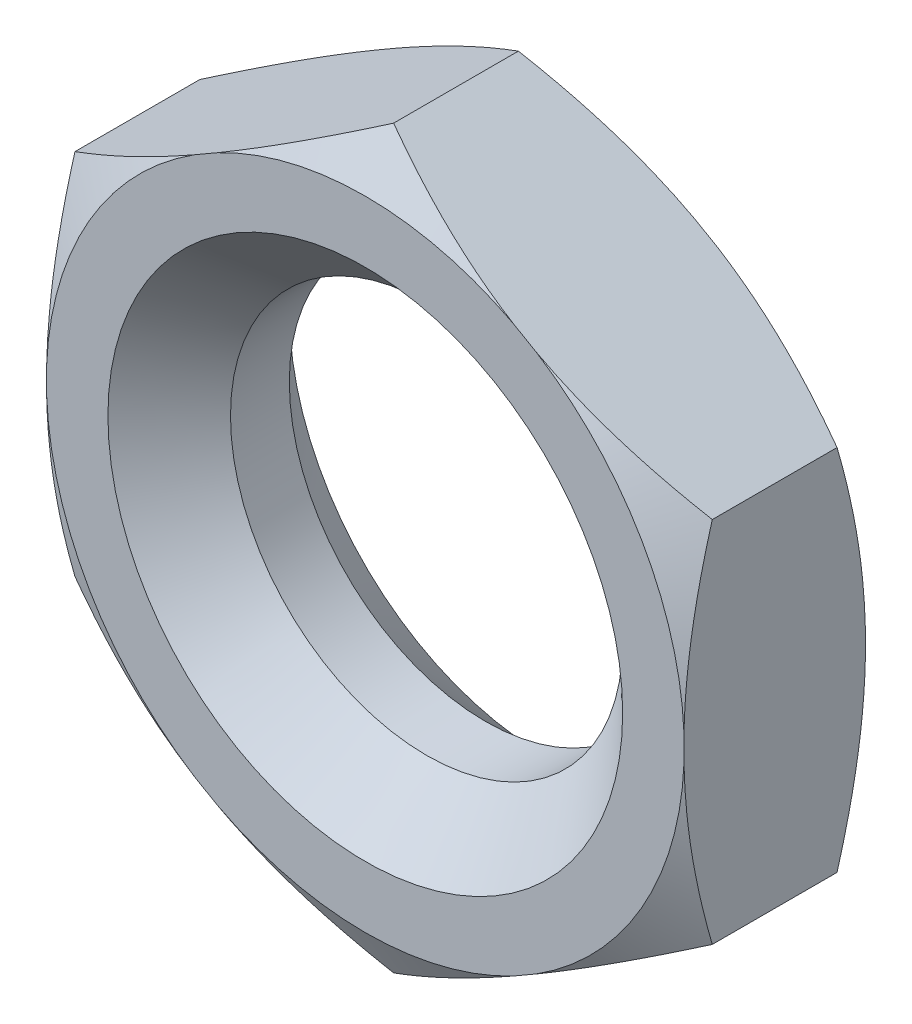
ISO-10303-21;
HEADER;
FILE_DESCRIPTION(('STEP AP214'),'2;1');
FILE_NAME('part.step','',(''),(''),'','','');
FILE_SCHEMA(('AUTOMOTIVE_DESIGN { 1 0 10303 214 1 1 1 1 }'));
ENDSEC;
DATA;
#1=APPLICATION_CONTEXT('core data for automotive mechanical design processes');
#2=APPLICATION_PROTOCOL_DEFINITION('international standard','automotive_design',2000,#1);
#3=PRODUCT_CONTEXT('',#1,'mechanical');
#4=PRODUCT('Part','Part','',(#3));
#5=PRODUCT_RELATED_PRODUCT_CATEGORY('part','',(#4));
#6=PRODUCT_DEFINITION_FORMATION('','',#4);
#7=PRODUCT_DEFINITION_CONTEXT('part definition',#1,'design');
#8=PRODUCT_DEFINITION('design','',#6,#7);
#9=PRODUCT_DEFINITION_SHAPE('','',#8);
#10=(LENGTH_UNIT() NAMED_UNIT(*) SI_UNIT(.MILLI.,.METRE.));
#11=(NAMED_UNIT(*) PLANE_ANGLE_UNIT() SI_UNIT($,.RADIAN.));
#12=(NAMED_UNIT(*) SI_UNIT($,.STERADIAN.) SOLID_ANGLE_UNIT());
#13=UNCERTAINTY_MEASURE_WITH_UNIT(LENGTH_MEASURE(1.E-05),#10,'distance_accuracy_value','');
#14=(GEOMETRIC_REPRESENTATION_CONTEXT(3) GLOBAL_UNCERTAINTY_ASSIGNED_CONTEXT((#13)) GLOBAL_UNIT_ASSIGNED_CONTEXT((#10,
#11,#12)) REPRESENTATION_CONTEXT('',''));
#15=CARTESIAN_POINT('',(0.,0.,0.));
#16=DIRECTION('',(0.,0.,1.));
#17=DIRECTION('',(1.,0.,0.));
#18=AXIS2_PLACEMENT_3D('',#15,#16,#17);
#19=CARTESIAN_POINT('',(6.5,3.75277674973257,1.85));
#20=DIRECTION('',(-0.5,-0.866025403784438,0.));
#21=DIRECTION('',(0.866025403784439,-0.5,0.));
#22=AXIS2_PLACEMENT_3D('',#19,#20,#21);
#23=PLANE('',#22);
#24=CARTESIAN_POINT('',(-4.51683591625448,10.1133499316,0.7888495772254));
#25=CARTESIAN_POINT('',(-4.31259048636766,9.99542877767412,0.678621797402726));
#26=CARTESIAN_POINT('',(-4.10785665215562,9.87722564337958,0.56958218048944));
#27=CARTESIAN_POINT('',(-3.69720622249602,9.64013650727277,0.354437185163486));
#28=CARTESIAN_POINT('',(-3.49128948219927,9.52125042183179,0.248332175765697));
#29=CARTESIAN_POINT('',(-3.07745623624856,9.28232368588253,0.0393077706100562));
#30=CARTESIAN_POINT('',(-2.86953543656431,9.16228055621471,-0.0636003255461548));
#31=CARTESIAN_POINT('',(-2.45213706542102,8.92129549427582,-0.265107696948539));
#32=CARTESIAN_POINT('',(-2.24265954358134,8.8003535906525,-0.3637071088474));
#33=CARTESIAN_POINT('',(-1.81653821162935,8.55433232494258,-0.558098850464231));
#34=CARTESIAN_POINT('',(-1.59984780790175,8.42922606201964,-0.653755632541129));
#35=CARTESIAN_POINT('',(-1.16428212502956,8.17775209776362,-0.83826300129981));
#36=CARTESIAN_POINT('',(-0.945406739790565,8.05138433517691,-0.927113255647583));
#37=CARTESIAN_POINT('',(-0.505419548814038,7.79735761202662,-1.09631802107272));
#38=CARTESIAN_POINT('',(-0.284310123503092,7.66970002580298,-1.17668070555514));
#39=CARTESIAN_POINT('',(0.16050468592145,7.41288607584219,-1.3270569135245));
#40=CARTESIAN_POINT('',(0.384209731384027,7.28372990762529,-1.39707177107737));
#41=CARTESIAN_POINT('',(0.919149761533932,6.97488213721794,-1.54851596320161));
#42=CARTESIAN_POINT('',(1.23163056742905,6.7944712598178,-1.6243188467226));
#43=CARTESIAN_POINT('',(1.70355968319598,6.52200285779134,-1.71546633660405));
#44=CARTESIAN_POINT('',(1.86140139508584,6.43087290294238,-1.74208910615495));
#45=CARTESIAN_POINT('',(2.17795197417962,6.24811234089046,-1.7871465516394));
#46=CARTESIAN_POINT('',(2.33666072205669,6.15648180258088,-1.80558232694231));
#47=CARTESIAN_POINT('',(2.65282150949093,5.97394628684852,-1.83357687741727));
#48=CARTESIAN_POINT('',(2.81026686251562,5.88304516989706,-1.8432358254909));
#49=CARTESIAN_POINT('',(3.12537866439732,5.70111528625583,-1.85375278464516));
#50=CARTESIAN_POINT('',(3.28304511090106,5.61008652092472,-1.85461088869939));
#51=CARTESIAN_POINT('',(3.5982269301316,5.42811621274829,-1.84749894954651));
#52=CARTESIAN_POINT('',(3.75574230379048,5.33717466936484,-1.83952896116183));
#53=CARTESIAN_POINT('',(4.07028693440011,5.15557224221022,-1.81500216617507));
#54=CARTESIAN_POINT('',(4.22731611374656,5.06491140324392,-1.79844405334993));
#55=CARTESIAN_POINT('',(4.59809635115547,4.85084133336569,-1.74962743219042));
#56=CARTESIAN_POINT('',(4.81150125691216,4.72763195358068,-1.71383628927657));
#57=CARTESIAN_POINT('',(5.23627318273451,4.48238976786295,-1.62873191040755));
#58=CARTESIAN_POINT('',(5.44763990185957,4.36035713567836,-1.57941670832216));
#59=CARTESIAN_POINT('',(5.86830756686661,4.11748454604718,-1.46912557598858));
#60=CARTESIAN_POINT('',(6.07760589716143,3.99664609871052,-1.40813648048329));
#61=CARTESIAN_POINT('',(6.49385501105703,3.75632456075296,-1.27641926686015));
#62=CARTESIAN_POINT('',(6.70080594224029,3.63684138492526,-1.2056917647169));
#63=CARTESIAN_POINT('',(7.11495909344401,3.39772995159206,-1.05528649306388));
#64=CARTESIAN_POINT('',(7.32213473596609,3.2781170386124,-0.975511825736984));
#65=CARTESIAN_POINT('',(7.73429095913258,3.04015853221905,-0.809249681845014));
#66=CARTESIAN_POINT('',(7.93927289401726,2.92181215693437,-0.722766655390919));
#67=CARTESIAN_POINT('',(8.34736787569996,2.68619840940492,-0.544276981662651));
#68=CARTESIAN_POINT('',(8.55048130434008,2.56893081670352,-0.452271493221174));
#69=CARTESIAN_POINT('',(8.95511455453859,2.33531570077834,-0.263703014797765));
#70=CARTESIAN_POINT('',(9.15663434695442,2.21896819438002,-0.16713994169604));
#71=CARTESIAN_POINT('',(9.49766593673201,2.02207351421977,3.81605592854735E-05));
#72=CARTESIAN_POINT('',(9.63753420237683,1.94132053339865,0.0696876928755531));
#73=CARTESIAN_POINT('',(9.91665382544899,1.78017074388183,0.210601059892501));
#74=CARTESIAN_POINT('',(10.0559052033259,1.69977392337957,0.281864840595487));
#75=CARTESIAN_POINT('',(10.3323795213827,1.54015140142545,0.425051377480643));
#76=CARTESIAN_POINT('',(10.4696083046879,1.46092232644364,0.496959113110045));
#77=CARTESIAN_POINT('',(10.7435768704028,1.30274650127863,0.642013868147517));
#78=CARTESIAN_POINT('',(10.8803166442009,1.22379975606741,0.715160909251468));
#79=CARTESIAN_POINT('',(11.0168359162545,1.14498031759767,0.788849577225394));
#80=B_SPLINE_CURVE_WITH_KNOTS('',3,(#24,#25,#26,#27,#28,#29,#30,#31,#32,#33,#34,#35,#36,#37,#38,
#39,#40,#41,#42,#43,#44,#45,#46,#47,#48,#49,#50,#51,#52,#53,#54,#55,#56,#57,#58,#59,#60,#61,#62,
#63,#64,#65,#66,#67,#68,#69,#70,#71,#72,#73,#74,#75,#76,#77,#78,#79),.UNSPECIFIED.,.F.,.F.,(4,2,
2,2,2,2,2,2,2,2,2,2,2,2,2,2,2,2,2,2,2,2,2,2,2,2,2,4),(0.,0.780998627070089,1.56209501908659,
2.34569478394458,3.12926967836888,3.93281100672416,4.73639154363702,5.53919104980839,
6.34188696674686,7.44678308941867,7.99921282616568,8.55156835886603,9.09753745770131,
9.64350078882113,10.1894607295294,10.7355037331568,11.4820655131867,12.2287358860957,
12.9762533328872,13.7237235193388,14.4801303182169,15.2360395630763,15.991790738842,
16.7475557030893,17.2751995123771,17.8028256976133,18.3248521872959,18.8468878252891),.UNSPECIFIED.);
#81=CARTESIAN_POINT('',(0.,7.50555349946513,-1.27264973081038));
#82=VERTEX_POINT('',#81);
#83=CARTESIAN_POINT('',(3.01725604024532,5.76353991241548,-1.85));
#84=VERTEX_POINT('',#83);
#85=EDGE_CURVE('E177',#82,#84,#80,.T.);
#86=ORIENTED_EDGE('',*,*,#85,.F.);
#87=DIRECTION('',(0.,0.,-1.));
#88=VECTOR('',#87,1.);
#89=CARTESIAN_POINT('',(0.,7.50555349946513,1.85));
#90=LINE('',#89,#88);
#91=CARTESIAN_POINT('',(0.,7.50555349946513,1.27264973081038));
#92=VERTEX_POINT('',#91);
#93=EDGE_CURVE('E223',#92,#82,#90,.T.);
#94=ORIENTED_EDGE('',*,*,#93,.F.);
#95=CARTESIAN_POINT('',(11.0168359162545,1.14498031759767,-0.788849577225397));
#96=CARTESIAN_POINT('',(10.8125904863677,1.26290147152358,-0.678621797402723));
#97=CARTESIAN_POINT('',(10.6078566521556,1.38110460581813,-0.569582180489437));
#98=CARTESIAN_POINT('',(10.197206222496,1.61819374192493,-0.354437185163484));
#99=CARTESIAN_POINT('',(9.99128948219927,1.73707982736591,-0.248332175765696));
#100=CARTESIAN_POINT('',(9.57745623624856,1.97600656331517,-0.0393077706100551));
#101=CARTESIAN_POINT('',(9.36953543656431,2.09604969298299,0.0636003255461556));
#102=CARTESIAN_POINT('',(8.95213706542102,2.33703475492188,0.26510769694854));
#103=CARTESIAN_POINT('',(8.74265954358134,2.4579766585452,0.3637071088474));
#104=CARTESIAN_POINT('',(8.31653821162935,2.70399792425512,0.558098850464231));
#105=CARTESIAN_POINT('',(8.09984780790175,2.82910418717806,0.653755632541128));
#106=CARTESIAN_POINT('',(7.66428212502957,3.08057815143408,0.838263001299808));
#107=CARTESIAN_POINT('',(7.44540673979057,3.2069459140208,0.927113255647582));
#108=CARTESIAN_POINT('',(7.00541954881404,3.46097263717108,1.09631802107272));
#109=CARTESIAN_POINT('',(6.78431012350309,3.58863022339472,1.17668070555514));
#110=CARTESIAN_POINT('',(6.33949531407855,3.84544417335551,1.3270569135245));
#111=CARTESIAN_POINT('',(6.11579026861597,3.97460034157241,1.39707177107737));
#112=CARTESIAN_POINT('',(5.58085023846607,4.28344811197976,1.54851596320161));
#113=CARTESIAN_POINT('',(5.26836943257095,4.4638589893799,1.6243188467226));
#114=CARTESIAN_POINT('',(4.79644031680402,4.73632739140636,1.71546633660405));
#115=CARTESIAN_POINT('',(4.63859860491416,4.82745734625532,1.74208910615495));
#116=CARTESIAN_POINT('',(4.32204802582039,5.01021790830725,1.7871465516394));
#117=CARTESIAN_POINT('',(4.16333927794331,5.10184844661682,1.80558232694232));
#118=CARTESIAN_POINT('',(3.84717849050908,5.28438396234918,1.83357687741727));
#119=CARTESIAN_POINT('',(3.68973313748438,5.37528507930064,1.8432358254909));
#120=CARTESIAN_POINT('',(3.37462133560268,5.55721496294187,1.85375278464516));
#121=CARTESIAN_POINT('',(3.21695488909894,5.64824372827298,1.85461088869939));
#122=CARTESIAN_POINT('',(2.9017730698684,5.83021403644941,1.84749894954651));
#123=CARTESIAN_POINT('',(2.74425769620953,5.92115557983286,1.83952896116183));
#124=CARTESIAN_POINT('',(2.4297130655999,6.10275800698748,1.81500216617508));
#125=CARTESIAN_POINT('',(2.27268388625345,6.19341884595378,1.79844405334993));
#126=CARTESIAN_POINT('',(1.90190364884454,6.40748891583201,1.74962743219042));
#127=CARTESIAN_POINT('',(1.68849874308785,6.53069829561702,1.71383628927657));
#128=CARTESIAN_POINT('',(1.2637268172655,6.77594048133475,1.62873191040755));
#129=CARTESIAN_POINT('',(1.05236009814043,6.89797311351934,1.57941670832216));
#130=CARTESIAN_POINT('',(0.631692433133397,7.14084570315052,1.46912557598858));
#131=CARTESIAN_POINT('',(0.422394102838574,7.26168415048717,1.40813648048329));
#132=CARTESIAN_POINT('',(0.00614498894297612,7.50200568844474,1.27641926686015));
#133=CARTESIAN_POINT('',(-0.200805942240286,7.62148886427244,1.2056917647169));
#134=CARTESIAN_POINT('',(-0.614959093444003,7.86060029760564,1.05528649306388));
#135=CARTESIAN_POINT('',(-0.822134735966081,7.98021321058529,0.975511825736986));
#136=CARTESIAN_POINT('',(-1.23429095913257,8.21817171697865,0.809249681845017));
#137=CARTESIAN_POINT('',(-1.43927289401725,8.33651809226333,0.722766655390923));
#138=CARTESIAN_POINT('',(-1.84736787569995,8.57213183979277,0.544276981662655));
#139=CARTESIAN_POINT('',(-2.05048130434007,8.68939943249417,0.452271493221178));
#140=CARTESIAN_POINT('',(-2.45511455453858,8.92301454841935,0.263703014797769));
#141=CARTESIAN_POINT('',(-2.65663434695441,9.03936205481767,0.167139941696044));
#142=CARTESIAN_POINT('',(-2.997665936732,9.23625673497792,-3.81605592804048E-05));
#143=CARTESIAN_POINT('',(-3.13753420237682,9.31700971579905,-0.0696876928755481));
#144=CARTESIAN_POINT('',(-3.41665382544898,9.47815950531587,-0.210601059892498));
#145=CARTESIAN_POINT('',(-3.55590520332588,9.55855632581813,-0.281864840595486));
#146=CARTESIAN_POINT('',(-3.8323795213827,9.71817884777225,-0.425051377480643));
#147=CARTESIAN_POINT('',(-3.96960830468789,9.79740792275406,-0.496959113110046));
#148=CARTESIAN_POINT('',(-4.24357687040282,9.95558374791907,-0.642013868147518));
#149=CARTESIAN_POINT('',(-4.38031664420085,10.0345304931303,-0.715160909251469));
#150=CARTESIAN_POINT('',(-4.51683591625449,10.1133499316,-0.788849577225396));
#151=B_SPLINE_CURVE_WITH_KNOTS('',3,(#95,#96,#97,#98,#99,#100,#101,#102,#103,#104,#105,#106,
#107,#108,#109,#110,#111,#112,#113,#114,#115,#116,#117,#118,#119,#120,#121,#122,#123,#124,#125,
#126,#127,#128,#129,#130,#131,#132,#133,#134,#135,#136,#137,#138,#139,#140,#141,#142,#143,#144,
#145,#146,#147,#148,#149,#150),.UNSPECIFIED.,.F.,.F.,(4,2,2,2,2,2,2,2,2,2,2,2,2,2,2,2,2,2,2,2,2,
2,2,2,2,2,2,4),(0.,0.780998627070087,1.56209501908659,2.34569478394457,3.12926967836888,
3.93281100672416,4.73639154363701,5.53919104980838,6.34188696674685,7.44678308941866,
7.99921282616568,8.55156835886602,9.0975374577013,9.64350078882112,10.1894607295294,
10.7355037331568,11.4820655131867,12.2287358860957,12.9762533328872,13.7237235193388,
14.4801303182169,15.2360395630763,15.991790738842,16.7475557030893,17.2751995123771,
17.8028256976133,18.3248521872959,18.8468878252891),.UNSPECIFIED.);
#152=CARTESIAN_POINT('',(3.01725604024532,5.76353991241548,1.85));
#153=VERTEX_POINT('',#152);
#154=EDGE_CURVE('E373',#153,#92,#151,.T.);
#155=ORIENTED_EDGE('',*,*,#154,.F.);
#156=DIRECTION('',(-0.866025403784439,0.5,0.));
#157=VECTOR('',#156,1.);
#158=CARTESIAN_POINT('',(6.5,3.75277674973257,1.85));
#159=LINE('',#158,#157);
#160=CARTESIAN_POINT('',(3.48274395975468,5.49479033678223,1.85));
#161=VERTEX_POINT('',#160);
#162=EDGE_CURVE('E352',#161,#153,#159,.T.);
#163=ORIENTED_EDGE('',*,*,#162,.F.);
#164=CARTESIAN_POINT('',(6.5,3.75277674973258,1.27264973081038));
#165=VERTEX_POINT('',#164);
#166=EDGE_CURVE('E194',#165,#161,#151,.T.);
#167=ORIENTED_EDGE('',*,*,#166,.F.);
#168=DIRECTION('',(0.,0.,-1.));
#169=VECTOR('',#168,1.);
#170=CARTESIAN_POINT('',(6.5,3.75277674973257,1.85));
#171=LINE('',#170,#169);
#172=CARTESIAN_POINT('',(6.5,3.75277674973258,-1.27264973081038));
#173=VERTEX_POINT('',#172);
#174=EDGE_CURVE('E183',#165,#173,#171,.T.);
#175=ORIENTED_EDGE('',*,*,#174,.T.);
#176=CARTESIAN_POINT('',(3.48274395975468,5.49479033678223,-1.85));
#177=VERTEX_POINT('',#176);
#178=EDGE_CURVE('E164',#177,#173,#80,.T.);
#179=ORIENTED_EDGE('',*,*,#178,.F.);
#180=DIRECTION('',(-0.866025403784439,0.5,0.));
#181=VECTOR('',#180,1.);
#182=CARTESIAN_POINT('',(6.5,3.75277674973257,-1.85));
#183=LINE('',#182,#181);
#184=EDGE_CURVE('E266',#177,#84,#183,.T.);
#185=ORIENTED_EDGE('',*,*,#184,.T.);
#186=EDGE_LOOP('',(#86,#94,#155,#163,#167,#175,#179,#185));
#187=FACE_BOUND('',#186,.T.);
#188=ADVANCED_FACE('F39',(#187),#23,.F.);
#189=CARTESIAN_POINT('',(0.,7.50555349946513,1.85));
#190=DIRECTION('',(0.5,-0.866025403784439,0.));
#191=DIRECTION('',(0.866025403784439,0.5,0.));
#192=AXIS2_PLACEMENT_3D('',#189,#190,#191);
#193=PLANE('',#192);
#194=CARTESIAN_POINT('',(-11.0168359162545,1.14498031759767,0.788849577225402));
#195=CARTESIAN_POINT('',(-10.8125904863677,1.26290147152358,0.678621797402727));
#196=CARTESIAN_POINT('',(-10.6078566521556,1.38110460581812,0.569582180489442));
#197=CARTESIAN_POINT('',(-10.197206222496,1.61819374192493,0.354437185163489));
#198=CARTESIAN_POINT('',(-9.99128948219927,1.73707982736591,0.2483321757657));
#199=CARTESIAN_POINT('',(-9.57745623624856,1.97600656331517,0.0393077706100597));
#200=CARTESIAN_POINT('',(-9.36953543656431,2.09604969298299,-0.063600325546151));
#201=CARTESIAN_POINT('',(-8.95213706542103,2.33703475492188,-0.265107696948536));
#202=CARTESIAN_POINT('',(-8.74265954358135,2.45797665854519,-0.363707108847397));
#203=CARTESIAN_POINT('',(-8.31653821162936,2.70399792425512,-0.558098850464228));
#204=CARTESIAN_POINT('',(-8.09984780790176,2.82910418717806,-0.653755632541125));
#205=CARTESIAN_POINT('',(-7.66428212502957,3.08057815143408,-0.838263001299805));
#206=CARTESIAN_POINT('',(-7.44540673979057,3.2069459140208,-0.927113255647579));
#207=CARTESIAN_POINT('',(-7.00541954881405,3.46097263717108,-1.09631802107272));
#208=CARTESIAN_POINT('',(-6.7843101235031,3.58863022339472,-1.17668070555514));
#209=CARTESIAN_POINT('',(-6.33949531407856,3.84544417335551,-1.3270569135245));
#210=CARTESIAN_POINT('',(-6.11579026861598,3.97460034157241,-1.39707177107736));
#211=CARTESIAN_POINT('',(-5.58085023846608,4.28344811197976,-1.54851596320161));
#212=CARTESIAN_POINT('',(-5.26836943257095,4.4638589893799,-1.6243188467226));
#213=CARTESIAN_POINT('',(-4.79644031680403,4.73632739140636,-1.71546633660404));
#214=CARTESIAN_POINT('',(-4.63859860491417,4.82745734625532,-1.74208910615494));
#215=CARTESIAN_POINT('',(-4.32204802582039,5.01021790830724,-1.7871465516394));
#216=CARTESIAN_POINT('',(-4.16333927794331,5.10184844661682,-1.80558232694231));
#217=CARTESIAN_POINT('',(-3.84717849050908,5.28438396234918,-1.83357687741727));
#218=CARTESIAN_POINT('',(-3.68973313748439,5.37528507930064,-1.8432358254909));
#219=CARTESIAN_POINT('',(-3.37462133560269,5.55721496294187,-1.85375278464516));
#220=CARTESIAN_POINT('',(-3.21695488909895,5.64824372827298,-1.85461088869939));
#221=CARTESIAN_POINT('',(-2.90177306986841,5.8302140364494,-1.84749894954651));
#222=CARTESIAN_POINT('',(-2.74425769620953,5.92115557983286,-1.83952896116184));
#223=CARTESIAN_POINT('',(-2.42971306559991,6.10275800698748,-1.81500216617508));
#224=CARTESIAN_POINT('',(-2.27268388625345,6.19341884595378,-1.79844405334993));
#225=CARTESIAN_POINT('',(-1.90190364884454,6.407488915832,-1.74962743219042));
#226=CARTESIAN_POINT('',(-1.68849874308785,6.53069829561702,-1.71383628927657));
#227=CARTESIAN_POINT('',(-1.2637268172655,6.77594048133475,-1.62873191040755));
#228=CARTESIAN_POINT('',(-1.05236009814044,6.89797311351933,-1.57941670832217));
#229=CARTESIAN_POINT('',(-0.631692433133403,7.14084570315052,-1.46912557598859));
#230=CARTESIAN_POINT('',(-0.422394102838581,7.26168415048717,-1.40813648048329));
#231=CARTESIAN_POINT('',(-0.00614498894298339,7.50200568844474,-1.27641926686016));
#232=CARTESIAN_POINT('',(0.200805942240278,7.62148886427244,-1.2056917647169));
#233=CARTESIAN_POINT('',(0.614959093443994,7.86060029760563,-1.05528649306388));
#234=CARTESIAN_POINT('',(0.822134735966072,7.98021321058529,-0.975511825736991));
#235=CARTESIAN_POINT('',(1.23429095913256,8.21817171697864,-0.809249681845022));
#236=CARTESIAN_POINT('',(1.43927289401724,8.33651809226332,-0.722766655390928));
#237=CARTESIAN_POINT('',(1.84736787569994,8.57213183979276,-0.544276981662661));
#238=CARTESIAN_POINT('',(2.05048130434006,8.68939943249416,-0.452271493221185));
#239=CARTESIAN_POINT('',(2.45511455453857,8.92301454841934,-0.263703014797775));
#240=CARTESIAN_POINT('',(2.6566343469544,9.03936205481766,-0.16713994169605));
#241=CARTESIAN_POINT('',(2.99766593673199,9.23625673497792,3.81605592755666E-05));
#242=CARTESIAN_POINT('',(3.13753420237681,9.31700971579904,0.0696876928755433));
#243=CARTESIAN_POINT('',(3.41665382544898,9.47815950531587,0.210601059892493));
#244=CARTESIAN_POINT('',(3.55590520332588,9.55855632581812,0.281864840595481));
#245=CARTESIAN_POINT('',(3.8323795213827,9.71817884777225,0.42505137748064));
#246=CARTESIAN_POINT('',(3.96960830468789,9.79740792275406,0.496959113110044));
#247=CARTESIAN_POINT('',(4.24357687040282,9.95558374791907,0.642013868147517));
#248=CARTESIAN_POINT('',(4.38031664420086,10.0345304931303,0.715160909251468));
#249=CARTESIAN_POINT('',(4.51683591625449,10.1133499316,0.788849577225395));
#250=B_SPLINE_CURVE_WITH_KNOTS('',3,(#194,#195,#196,#197,#198,#199,#200,#201,#202,#203,#204,
#205,#206,#207,#208,#209,#210,#211,#212,#213,#214,#215,#216,#217,#218,#219,#220,#221,#222,#223,
#224,#225,#226,#227,#228,#229,#230,#231,#232,#233,#234,#235,#236,#237,#238,#239,#240,#241,#242,
#243,#244,#245,#246,#247,#248,#249),.UNSPECIFIED.,.F.,.F.,(4,2,2,2,2,2,2,2,2,2,2,2,2,2,2,2,2,2,
2,2,2,2,2,2,2,2,2,4),(0.,0.780998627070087,1.56209501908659,2.34569478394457,3.12926967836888,
3.93281100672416,4.73639154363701,5.53919104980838,6.34188696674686,7.44678308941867,
7.99921282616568,8.55156835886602,9.0975374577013,9.64350078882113,10.1894607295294,
10.7355037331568,11.4820655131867,12.2287358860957,12.9762533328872,13.7237235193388,
14.4801303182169,15.2360395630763,15.991790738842,16.7475557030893,17.2751995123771,
17.8028256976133,18.3248521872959,18.8468878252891),.UNSPECIFIED.);
#251=CARTESIAN_POINT('',(-6.5,3.75277674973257,-1.27264973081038));
#252=VERTEX_POINT('',#251);
#253=CARTESIAN_POINT('',(-3.48274395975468,5.49479033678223,-1.85));
#254=VERTEX_POINT('',#253);
#255=EDGE_CURVE('E55',#252,#254,#250,.T.);
#256=ORIENTED_EDGE('',*,*,#255,.F.);
#257=DIRECTION('',(0.,0.,-1.));
#258=VECTOR('',#257,1.);
#259=CARTESIAN_POINT('',(-6.5,3.75277674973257,1.85));
#260=LINE('',#259,#258);
#261=CARTESIAN_POINT('',(-6.5,3.75277674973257,1.27264973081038));
#262=VERTEX_POINT('',#261);
#263=EDGE_CURVE('E219',#262,#252,#260,.T.);
#264=ORIENTED_EDGE('',*,*,#263,.F.);
#265=CARTESIAN_POINT('',(4.51683591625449,10.1133499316,-0.788849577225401));
#266=CARTESIAN_POINT('',(4.31259048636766,9.99542877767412,-0.678621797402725));
#267=CARTESIAN_POINT('',(4.10785665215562,9.87722564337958,-0.569582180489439));
#268=CARTESIAN_POINT('',(3.69720622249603,9.64013650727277,-0.354437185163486));
#269=CARTESIAN_POINT('',(3.49128948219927,9.52125042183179,-0.248332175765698));
#270=CARTESIAN_POINT('',(3.07745623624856,9.28232368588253,-0.0393077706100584));
#271=CARTESIAN_POINT('',(2.86953543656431,9.16228055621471,0.063600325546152));
#272=CARTESIAN_POINT('',(2.45213706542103,8.92129549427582,0.265107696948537));
#273=CARTESIAN_POINT('',(2.24265954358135,8.80035359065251,0.363707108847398));
#274=CARTESIAN_POINT('',(1.81653821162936,8.55433232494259,0.55809885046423));
#275=CARTESIAN_POINT('',(1.59984780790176,8.42922606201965,0.653755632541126));
#276=CARTESIAN_POINT('',(1.16428212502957,8.17775209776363,0.838263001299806));
#277=CARTESIAN_POINT('',(0.945406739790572,8.05138433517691,0.92711325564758));
#278=CARTESIAN_POINT('',(0.505419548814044,7.79735761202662,1.09631802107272));
#279=CARTESIAN_POINT('',(0.284310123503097,7.66970002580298,1.17668070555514));
#280=CARTESIAN_POINT('',(-0.160504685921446,7.41288607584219,1.3270569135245));
#281=CARTESIAN_POINT('',(-0.384209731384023,7.2837299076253,1.39707177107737));
#282=CARTESIAN_POINT('',(-0.919149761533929,6.97488213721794,1.54851596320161));
#283=CARTESIAN_POINT('',(-1.23163056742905,6.7944712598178,1.6243188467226));
#284=CARTESIAN_POINT('',(-1.70355968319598,6.52200285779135,1.71546633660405));
#285=CARTESIAN_POINT('',(-1.86140139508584,6.43087290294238,1.74208910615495));
#286=CARTESIAN_POINT('',(-2.17795197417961,6.24811234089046,1.7871465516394));
#287=CARTESIAN_POINT('',(-2.33666072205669,6.15648180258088,1.80558232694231));
#288=CARTESIAN_POINT('',(-2.65282150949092,5.97394628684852,1.83357687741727));
#289=CARTESIAN_POINT('',(-2.81026686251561,5.88304516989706,1.8432358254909));
#290=CARTESIAN_POINT('',(-3.12537866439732,5.70111528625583,1.85375278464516));
#291=CARTESIAN_POINT('',(-3.28304511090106,5.61008652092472,1.85461088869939));
#292=CARTESIAN_POINT('',(-3.5982269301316,5.4281162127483,1.84749894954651));
#293=CARTESIAN_POINT('',(-3.75574230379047,5.33717466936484,1.83952896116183));
#294=CARTESIAN_POINT('',(-4.0702869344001,5.15557224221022,1.81500216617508));
#295=CARTESIAN_POINT('',(-4.22731611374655,5.06491140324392,1.79844405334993));
#296=CARTESIAN_POINT('',(-4.59809635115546,4.8508413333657,1.74962743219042));
#297=CARTESIAN_POINT('',(-4.81150125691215,4.72763195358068,1.71383628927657));
#298=CARTESIAN_POINT('',(-5.2362731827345,4.48238976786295,1.62873191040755));
#299=CARTESIAN_POINT('',(-5.44763990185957,4.36035713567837,1.57941670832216));
#300=CARTESIAN_POINT('',(-5.8683075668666,4.11748454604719,1.46912557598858));
#301=CARTESIAN_POINT('',(-6.07760589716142,3.99664609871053,1.40813648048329));
#302=CARTESIAN_POINT('',(-6.49385501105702,3.75632456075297,1.27641926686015));
#303=CARTESIAN_POINT('',(-6.70080594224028,3.63684138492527,1.2056917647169));
#304=CARTESIAN_POINT('',(-7.114959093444,3.39772995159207,1.05528649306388));
#305=CARTESIAN_POINT('',(-7.32213473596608,3.27811703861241,0.975511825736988));
#306=CARTESIAN_POINT('',(-7.73429095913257,3.04015853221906,0.809249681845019));
#307=CARTESIAN_POINT('',(-7.93927289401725,2.92181215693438,0.722766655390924));
#308=CARTESIAN_POINT('',(-8.34736787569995,2.68619840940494,0.544276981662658));
#309=CARTESIAN_POINT('',(-8.55048130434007,2.56893081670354,0.452271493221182));
#310=CARTESIAN_POINT('',(-8.95511455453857,2.33531570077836,0.263703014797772));
#311=CARTESIAN_POINT('',(-9.15663434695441,2.21896819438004,0.167139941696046));
#312=CARTESIAN_POINT('',(-9.49766593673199,2.02207351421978,-3.81605592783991E-05));
#313=CARTESIAN_POINT('',(-9.63753420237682,1.94132053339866,-0.0696876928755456));
#314=CARTESIAN_POINT('',(-9.91665382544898,1.78017074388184,-0.210601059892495));
#315=CARTESIAN_POINT('',(-10.0559052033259,1.69977392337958,-0.281864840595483));
#316=CARTESIAN_POINT('',(-10.3323795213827,1.54015140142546,-0.425051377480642));
#317=CARTESIAN_POINT('',(-10.4696083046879,1.46092232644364,-0.496959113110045));
#318=CARTESIAN_POINT('',(-10.7435768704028,1.30274650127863,-0.642013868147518));
#319=CARTESIAN_POINT('',(-10.8803166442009,1.22379975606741,-0.71516090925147));
#320=CARTESIAN_POINT('',(-11.0168359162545,1.14498031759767,-0.788849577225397));
#321=B_SPLINE_CURVE_WITH_KNOTS('',3,(#265,#266,#267,#268,#269,#270,#271,#272,#273,#274,#275,
#276,#277,#278,#279,#280,#281,#282,#283,#284,#285,#286,#287,#288,#289,#290,#291,#292,#293,#294,
#295,#296,#297,#298,#299,#300,#301,#302,#303,#304,#305,#306,#307,#308,#309,#310,#311,#312,#313,
#314,#315,#316,#317,#318,#319,#320),.UNSPECIFIED.,.F.,.F.,(4,2,2,2,2,2,2,2,2,2,2,2,2,2,2,2,2,2,
2,2,2,2,2,2,2,2,2,4),(0.,0.780998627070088,1.56209501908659,2.34569478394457,3.12926967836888,
3.93281100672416,4.73639154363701,5.53919104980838,6.34188696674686,7.44678308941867,
7.99921282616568,8.55156835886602,9.0975374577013,9.64350078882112,10.1894607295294,
10.7355037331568,11.4820655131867,12.2287358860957,12.9762533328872,13.7237235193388,
14.4801303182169,15.2360395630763,15.991790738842,16.7475557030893,17.2751995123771,
17.8028256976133,18.3248521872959,18.8468878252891),.UNSPECIFIED.);
#322=CARTESIAN_POINT('',(-3.48274395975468,5.49479033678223,1.85));
#323=VERTEX_POINT('',#322);
#324=EDGE_CURVE('E345',#323,#262,#321,.T.);
#325=ORIENTED_EDGE('',*,*,#324,.F.);
#326=DIRECTION('',(-0.866025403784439,-0.5,0.));
#327=VECTOR('',#326,1.);
#328=CARTESIAN_POINT('',(0.,7.50555349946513,1.85));
#329=LINE('',#328,#327);
#330=CARTESIAN_POINT('',(-3.01725604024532,5.76353991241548,1.85));
#331=VERTEX_POINT('',#330);
#332=EDGE_CURVE('E356',#331,#323,#329,.T.);
#333=ORIENTED_EDGE('',*,*,#332,.F.);
#334=EDGE_CURVE('E351',#92,#331,#321,.T.);
#335=ORIENTED_EDGE('',*,*,#334,.F.);
#336=ORIENTED_EDGE('',*,*,#93,.T.);
#337=CARTESIAN_POINT('',(-3.01725604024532,5.76353991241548,-1.85));
#338=VERTEX_POINT('',#337);
#339=EDGE_CURVE('E397',#338,#82,#250,.T.);
#340=ORIENTED_EDGE('',*,*,#339,.F.);
#341=DIRECTION('',(-0.866025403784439,-0.5,0.));
#342=VECTOR('',#341,1.);
#343=CARTESIAN_POINT('',(0.,7.50555349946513,-1.85));
#344=LINE('',#343,#342);
#345=EDGE_CURVE('E372',#338,#254,#344,.T.);
#346=ORIENTED_EDGE('',*,*,#345,.T.);
#347=EDGE_LOOP('',(#256,#264,#325,#333,#335,#336,#340,#346));
#348=FACE_BOUND('',#347,.T.);
#349=ADVANCED_FACE('F325',(#348),#193,.F.);
#350=CARTESIAN_POINT('',(-6.5,3.75277674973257,1.85));
#351=DIRECTION('',(1.,0.,0.));
#352=DIRECTION('',(0.,1.,0.));
#353=AXIS2_PLACEMENT_3D('',#350,#351,#352);
#354=PLANE('',#353);
#355=CARTESIAN_POINT('',(-6.5,-8.26961266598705,0.466811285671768));
#356=CARTESIAN_POINT('',(-6.5,-8.03476604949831,0.36023910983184));
#357=CARTESIAN_POINT('',(-6.5,-7.79927743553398,0.255054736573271));
#358=CARTESIAN_POINT('',(-6.5,-7.32674119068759,0.0481349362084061));
#359=CARTESIAN_POINT('',(-6.5,-7.08969328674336,-0.0535998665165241));
#360=CARTESIAN_POINT('',(-6.5,-6.61285534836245,-0.25332401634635));
#361=CARTESIAN_POINT('',(-6.5,-6.37305800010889,-0.351295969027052));
#362=CARTESIAN_POINT('',(-6.5,-5.89143720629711,-0.542113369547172));
#363=CARTESIAN_POINT('',(-6.5,-5.64961385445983,-0.634959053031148));
#364=CARTESIAN_POINT('',(-6.5,-5.16472230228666,-0.813983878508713));
#365=CARTESIAN_POINT('',(-6.5,-4.92166442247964,-0.900190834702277));
#366=CARTESIAN_POINT('',(-6.5,-4.4329513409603,-1.06499502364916));
#367=CARTESIAN_POINT('',(-6.5,-4.18729601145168,-1.14359188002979));
#368=CARTESIAN_POINT('',(-6.5,-3.69351542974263,-1.29137421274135));
#369=CARTESIAN_POINT('',(-6.5,-3.44539400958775,-1.36057239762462));
#370=CARTESIAN_POINT('',(-6.5,-2.94625558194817,-1.4877186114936));
#371=CARTESIAN_POINT('',(-6.5,-2.69523870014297,-1.54566712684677));
#372=CARTESIAN_POINT('',(-6.5,-2.26193759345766,-1.63367550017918));
#373=CARTESIAN_POINT('',(-6.5,-2.08031337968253,-1.66698629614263));
#374=CARTESIAN_POINT('',(-6.5,-1.71584711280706,-1.72596807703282));
#375=CARTESIAN_POINT('',(-6.5,-1.53300526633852,-1.75164032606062));
#376=CARTESIAN_POINT('',(-6.5,-1.16637276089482,-1.79467423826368));
#377=CARTESIAN_POINT('',(-6.5,-0.982582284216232,-1.812037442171));
#378=CARTESIAN_POINT('',(-6.5,-0.614375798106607,-1.83795638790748));
#379=CARTESIAN_POINT('',(-6.5,-0.429959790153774,-1.84651215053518));
#380=CARTESIAN_POINT('',(-6.5,-0.0610238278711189,-1.85454935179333));
#381=CARTESIAN_POINT('',(-6.5,0.123496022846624,-1.85403549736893));
#382=CARTESIAN_POINT('',(-6.5,0.492284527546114,-1.84396173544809));
#383=CARTESIAN_POINT('',(-6.5,0.676553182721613,-1.834401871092));
#384=CARTESIAN_POINT('',(-6.5,1.04442975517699,-1.80652773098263));
#385=CARTESIAN_POINT('',(-6.5,1.22803765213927,-1.78821318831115));
#386=CARTESIAN_POINT('',(-6.5,1.59425932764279,-1.74335884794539));
#387=CARTESIAN_POINT('',(-6.5,1.77687291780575,-1.71681754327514));
#388=CARTESIAN_POINT('',(-6.5,2.50513699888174,-1.59547944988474));
#389=CARTESIAN_POINT('',(-6.5,3.04588502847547,-1.47039077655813));
#390=CARTESIAN_POINT('',(-6.5,3.84700783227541,-1.24730102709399));
#391=CARTESIAN_POINT('',(-6.5,4.11273096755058,-1.16689691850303));
#392=CARTESIAN_POINT('',(-6.5,4.64110996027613,-0.996501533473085));
#393=CARTESIAN_POINT('',(-6.5,4.90376603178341,-0.9065109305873));
#394=CARTESIAN_POINT('',(-6.5,5.42928469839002,-0.717755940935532));
#395=CARTESIAN_POINT('',(-6.5,5.69211488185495,-0.618902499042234));
#396=CARTESIAN_POINT('',(-6.5,6.21531995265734,-0.414867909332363));
#397=CARTESIAN_POINT('',(-6.5,6.47569468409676,-0.309686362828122));
#398=CARTESIAN_POINT('',(-6.5,6.99270389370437,-0.094909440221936));
#399=CARTESIAN_POINT('',(-6.5,7.24935156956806,0.0146543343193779));
#400=CARTESIAN_POINT('',(-6.5,7.76078624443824,0.237878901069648));
#401=CARTESIAN_POINT('',(-6.5,8.01557368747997,0.351538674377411));
#402=CARTESIAN_POINT('',(-6.5,8.26961266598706,0.46681128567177));
#403=B_SPLINE_CURVE_WITH_KNOTS('',3,(#355,#356,#357,#358,#359,#360,#361,#362,#363,#364,#365,
#366,#367,#368,#369,#370,#371,#372,#373,#374,#375,#376,#377,#378,#379,#380,#381,#382,#383,#384,
#385,#386,#387,#388,#389,#390,#391,#392,#393,#394,#395,#396,#397,#398,#399,#400,#401,#402),
.UNSPECIFIED.,.F.,.F.,(4,2,2,2,2,2,2,2,2,2,2,2,2,2,2,2,2,2,2,2,2,2,2,4),(0.,0.773701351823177,
1.54754200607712,2.32461072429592,3.10164369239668,3.87522063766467,4.64883582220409,
5.42139431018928,6.1939193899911,6.74773919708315,7.30146730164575,7.85509268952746,
8.40871677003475,8.9620535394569,9.51538767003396,10.0687386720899,10.62219109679,
12.2833339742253,13.1161365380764,13.9488806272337,14.7912084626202,15.6335894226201,
16.4707192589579,17.3076422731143),.UNSPECIFIED.);
#404=CARTESIAN_POINT('',(-6.5,-3.75277674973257,-1.27264973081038));
#405=VERTEX_POINT('',#404);
#406=CARTESIAN_POINT('',(-6.5,-0.2687495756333,-1.85));
#407=VERTEX_POINT('',#406);
#408=EDGE_CURVE('E63',#405,#407,#403,.T.);
#409=ORIENTED_EDGE('',*,*,#408,.F.);
#410=DIRECTION('',(0.,0.,-1.));
#411=VECTOR('',#410,1.);
#412=CARTESIAN_POINT('',(-6.5,-3.75277674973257,1.85));
#413=LINE('',#412,#411);
#414=CARTESIAN_POINT('',(-6.5,-3.75277674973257,1.27264973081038));
#415=VERTEX_POINT('',#414);
#416=EDGE_CURVE('E215',#415,#405,#413,.T.);
#417=ORIENTED_EDGE('',*,*,#416,.F.);
#418=CARTESIAN_POINT('',(-6.5,8.26961266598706,-0.46681128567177));
#419=CARTESIAN_POINT('',(-6.5,8.03476604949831,-0.360239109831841));
#420=CARTESIAN_POINT('',(-6.5,7.79927743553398,-0.255054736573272));
#421=CARTESIAN_POINT('',(-6.5,7.32674119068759,-0.0481349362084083));
#422=CARTESIAN_POINT('',(-6.5,7.08969328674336,0.0535998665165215));
#423=CARTESIAN_POINT('',(-6.5,6.61285534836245,0.253324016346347));
#424=CARTESIAN_POINT('',(-6.5,6.3730580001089,0.351295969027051));
#425=CARTESIAN_POINT('',(-6.5,5.89143720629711,0.54211336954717));
#426=CARTESIAN_POINT('',(-6.5,5.64961385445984,0.634959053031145));
#427=CARTESIAN_POINT('',(-6.5,5.16472230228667,0.81398387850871));
#428=CARTESIAN_POINT('',(-6.5,4.92166442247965,0.900190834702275));
#429=CARTESIAN_POINT('',(-6.5,4.4329513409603,1.06499502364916));
#430=CARTESIAN_POINT('',(-6.5,4.18729601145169,1.14359188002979));
#431=CARTESIAN_POINT('',(-6.5,3.69351542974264,1.29137421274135));
#432=CARTESIAN_POINT('',(-6.5,3.44539400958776,1.36057239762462));
#433=CARTESIAN_POINT('',(-6.5,2.94625558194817,1.4877186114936));
#434=CARTESIAN_POINT('',(-6.5,2.69523870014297,1.54566712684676));
#435=CARTESIAN_POINT('',(-6.5,2.26193759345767,1.63367550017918));
#436=CARTESIAN_POINT('',(-6.5,2.08031337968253,1.66698629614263));
#437=CARTESIAN_POINT('',(-6.5,1.71584711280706,1.72596807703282));
#438=CARTESIAN_POINT('',(-6.5,1.53300526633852,1.75164032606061));
#439=CARTESIAN_POINT('',(-6.5,1.16637276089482,1.79467423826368));
#440=CARTESIAN_POINT('',(-6.5,0.982582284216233,1.812037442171));
#441=CARTESIAN_POINT('',(-6.5,0.614375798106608,1.83795638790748));
#442=CARTESIAN_POINT('',(-6.5,0.429959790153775,1.84651215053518));
#443=CARTESIAN_POINT('',(-6.5,0.0610238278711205,1.85454935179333));
#444=CARTESIAN_POINT('',(-6.5,-0.123496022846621,1.85403549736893));
#445=CARTESIAN_POINT('',(-6.5,-0.492284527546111,1.84396173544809));
#446=CARTESIAN_POINT('',(-6.5,-0.676553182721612,1.834401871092));
#447=CARTESIAN_POINT('',(-6.5,-1.04442975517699,1.80652773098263));
#448=CARTESIAN_POINT('',(-6.5,-1.22803765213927,1.78821318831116));
#449=CARTESIAN_POINT('',(-6.5,-1.59425932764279,1.74335884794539));
#450=CARTESIAN_POINT('',(-6.5,-1.77687291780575,1.71681754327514));
#451=CARTESIAN_POINT('',(-6.5,-2.50513699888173,1.59547944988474));
#452=CARTESIAN_POINT('',(-6.5,-3.04588502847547,1.47039077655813));
#453=CARTESIAN_POINT('',(-6.5,-3.84700783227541,1.247301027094));
#454=CARTESIAN_POINT('',(-6.5,-4.11273096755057,1.16689691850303));
#455=CARTESIAN_POINT('',(-6.5,-4.64110996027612,0.996501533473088));
#456=CARTESIAN_POINT('',(-6.5,-4.9037660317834,0.906510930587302));
#457=CARTESIAN_POINT('',(-6.5,-5.42928469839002,0.717755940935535));
#458=CARTESIAN_POINT('',(-6.5,-5.69211488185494,0.618902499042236));
#459=CARTESIAN_POINT('',(-6.5,-6.21531995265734,0.414867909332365));
#460=CARTESIAN_POINT('',(-6.5,-6.47569468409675,0.309686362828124));
#461=CARTESIAN_POINT('',(-6.5,-6.99270389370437,0.0949094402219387));
#462=CARTESIAN_POINT('',(-6.5,-7.24935156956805,-0.0146543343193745));
#463=CARTESIAN_POINT('',(-6.5,-7.76078624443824,-0.237878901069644));
#464=CARTESIAN_POINT('',(-6.5,-8.01557368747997,-0.351538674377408));
#465=CARTESIAN_POINT('',(-6.5,-8.26961266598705,-0.466811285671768));
#466=B_SPLINE_CURVE_WITH_KNOTS('',3,(#418,#419,#420,#421,#422,#423,#424,#425,#426,#427,#428,
#429,#430,#431,#432,#433,#434,#435,#436,#437,#438,#439,#440,#441,#442,#443,#444,#445,#446,#447,
#448,#449,#450,#451,#452,#453,#454,#455,#456,#457,#458,#459,#460,#461,#462,#463,#464,#465),
.UNSPECIFIED.,.F.,.F.,(4,2,2,2,2,2,2,2,2,2,2,2,2,2,2,2,2,2,2,2,2,2,2,4),(0.,0.773701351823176,
1.54754200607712,2.32461072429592,3.10164369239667,3.87522063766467,4.64883582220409,
5.42139431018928,6.1939193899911,6.74773919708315,7.30146730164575,7.85509268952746,
8.40871677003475,8.9620535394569,9.51538767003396,10.0687386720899,10.62219109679,
12.2833339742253,13.1161365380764,13.9488806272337,14.7912084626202,15.6335894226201,
16.4707192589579,17.3076422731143),.UNSPECIFIED.);
#467=CARTESIAN_POINT('',(-6.5,-0.2687495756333,1.85));
#468=VERTEX_POINT('',#467);
#469=EDGE_CURVE('E331',#468,#415,#466,.T.);
#470=ORIENTED_EDGE('',*,*,#469,.F.);
#471=DIRECTION('',(0.,-1.,0.));
#472=VECTOR('',#471,1.);
#473=CARTESIAN_POINT('',(-6.5,3.75277674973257,1.85));
#474=LINE('',#473,#472);
#475=CARTESIAN_POINT('',(-6.5,0.268749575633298,1.85));
#476=VERTEX_POINT('',#475);
#477=EDGE_CURVE('E360',#476,#468,#474,.T.);
#478=ORIENTED_EDGE('',*,*,#477,.F.);
#479=EDGE_CURVE('E338',#262,#476,#466,.T.);
#480=ORIENTED_EDGE('',*,*,#479,.F.);
#481=ORIENTED_EDGE('',*,*,#263,.T.);
#482=CARTESIAN_POINT('',(-6.5,0.268749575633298,-1.85));
#483=VERTEX_POINT('',#482);
#484=EDGE_CURVE('E314',#483,#252,#403,.T.);
#485=ORIENTED_EDGE('',*,*,#484,.F.);
#486=DIRECTION('',(0.,-1.,0.));
#487=VECTOR('',#486,1.);
#488=CARTESIAN_POINT('',(-6.5,3.75277674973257,-1.85));
#489=LINE('',#488,#487);
#490=EDGE_CURVE('E377',#483,#407,#489,.T.);
#491=ORIENTED_EDGE('',*,*,#490,.T.);
#492=EDGE_LOOP('',(#409,#417,#470,#478,#480,#481,#485,#491));
#493=FACE_BOUND('',#492,.T.);
#494=ADVANCED_FACE('F321',(#493),#354,.F.);
#495=CARTESIAN_POINT('',(-6.5,-3.75277674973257,1.85));
#496=DIRECTION('',(0.5,0.866025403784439,0.));
#497=DIRECTION('',(-0.866025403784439,0.5,0.));
#498=AXIS2_PLACEMENT_3D('',#495,#496,#497);
#499=PLANE('',#498);
#500=CARTESIAN_POINT('',(4.51683591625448,-10.1133499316,0.788849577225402));
#501=CARTESIAN_POINT('',(4.31259048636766,-9.99542877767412,0.678621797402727));
#502=CARTESIAN_POINT('',(4.10785665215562,-9.87722564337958,0.569582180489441));
#503=CARTESIAN_POINT('',(3.69720622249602,-9.64013650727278,0.354437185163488));
#504=CARTESIAN_POINT('',(3.49128948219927,-9.52125042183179,0.248332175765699));
#505=CARTESIAN_POINT('',(3.07745623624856,-9.28232368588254,0.039307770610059));
#506=CARTESIAN_POINT('',(2.86953543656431,-9.16228055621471,-0.0636003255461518));
#507=CARTESIAN_POINT('',(2.45213706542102,-8.92129549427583,-0.265107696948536));
#508=CARTESIAN_POINT('',(2.24265954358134,-8.80035359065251,-0.363707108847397));
#509=CARTESIAN_POINT('',(1.81653821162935,-8.55433232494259,-0.558098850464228));
#510=CARTESIAN_POINT('',(1.59984780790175,-8.42922606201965,-0.653755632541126));
#511=CARTESIAN_POINT('',(1.16428212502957,-8.17775209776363,-0.838263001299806));
#512=CARTESIAN_POINT('',(0.945406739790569,-8.05138433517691,-0.927113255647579));
#513=CARTESIAN_POINT('',(0.505419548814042,-7.79735761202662,-1.09631802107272));
#514=CARTESIAN_POINT('',(0.284310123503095,-7.66970002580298,-1.17668070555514));
#515=CARTESIAN_POINT('',(-0.160504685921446,-7.41288607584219,-1.3270569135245));
#516=CARTESIAN_POINT('',(-0.384209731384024,-7.2837299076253,-1.39707177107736));
#517=CARTESIAN_POINT('',(-0.919149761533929,-6.97488213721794,-1.54851596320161));
#518=CARTESIAN_POINT('',(-1.23163056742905,-6.7944712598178,-1.6243188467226));
#519=CARTESIAN_POINT('',(-1.70355968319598,-6.52200285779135,-1.71546633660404));
#520=CARTESIAN_POINT('',(-1.86140139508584,-6.43087290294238,-1.74208910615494));
#521=CARTESIAN_POINT('',(-2.17795197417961,-6.24811234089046,-1.7871465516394));
#522=CARTESIAN_POINT('',(-2.33666072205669,-6.15648180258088,-1.80558232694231));
#523=CARTESIAN_POINT('',(-2.65282150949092,-5.97394628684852,-1.83357687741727));
#524=CARTESIAN_POINT('',(-2.81026686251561,-5.88304516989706,-1.8432358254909));
#525=CARTESIAN_POINT('',(-3.12537866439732,-5.70111528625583,-1.85375278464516));
#526=CARTESIAN_POINT('',(-3.28304511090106,-5.61008652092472,-1.85461088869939));
#527=CARTESIAN_POINT('',(-3.5982269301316,-5.4281162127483,-1.84749894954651));
#528=CARTESIAN_POINT('',(-3.75574230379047,-5.33717466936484,-1.83952896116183));
#529=CARTESIAN_POINT('',(-4.0702869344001,-5.15557224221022,-1.81500216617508));
#530=CARTESIAN_POINT('',(-4.22731611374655,-5.06491140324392,-1.79844405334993));
#531=CARTESIAN_POINT('',(-4.59809635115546,-4.8508413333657,-1.74962743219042));
#532=CARTESIAN_POINT('',(-4.81150125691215,-4.72763195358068,-1.71383628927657));
#533=CARTESIAN_POINT('',(-5.2362731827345,-4.48238976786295,-1.62873191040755));
#534=CARTESIAN_POINT('',(-5.44763990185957,-4.36035713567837,-1.57941670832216));
#535=CARTESIAN_POINT('',(-5.8683075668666,-4.11748454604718,-1.46912557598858));
#536=CARTESIAN_POINT('',(-6.07760589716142,-3.99664609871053,-1.40813648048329));
#537=CARTESIAN_POINT('',(-6.49385501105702,-3.75632456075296,-1.27641926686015));
#538=CARTESIAN_POINT('',(-6.70080594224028,-3.63684138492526,-1.2056917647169));
#539=CARTESIAN_POINT('',(-7.114959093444,-3.39772995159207,-1.05528649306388));
#540=CARTESIAN_POINT('',(-7.32213473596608,-3.27811703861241,-0.975511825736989));
#541=CARTESIAN_POINT('',(-7.73429095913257,-3.04015853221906,-0.80924968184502));
#542=CARTESIAN_POINT('',(-7.93927289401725,-2.92181215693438,-0.722766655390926));
#543=CARTESIAN_POINT('',(-8.34736787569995,-2.68619840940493,-0.544276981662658));
#544=CARTESIAN_POINT('',(-8.55048130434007,-2.56893081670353,-0.452271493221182));
#545=CARTESIAN_POINT('',(-8.95511455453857,-2.33531570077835,-0.263703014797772));
#546=CARTESIAN_POINT('',(-9.15663434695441,-2.21896819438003,-0.167139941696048));
#547=CARTESIAN_POINT('',(-9.49766593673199,-2.02207351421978,3.81605592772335E-05));
#548=CARTESIAN_POINT('',(-9.63753420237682,-1.94132053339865,0.0696876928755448));
#549=CARTESIAN_POINT('',(-9.91665382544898,-1.78017074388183,0.210601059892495));
#550=CARTESIAN_POINT('',(-10.0559052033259,-1.69977392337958,0.281864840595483));
#551=CARTESIAN_POINT('',(-10.3323795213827,-1.54015140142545,0.425051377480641));
#552=CARTESIAN_POINT('',(-10.4696083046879,-1.46092232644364,0.496959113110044));
#553=CARTESIAN_POINT('',(-10.7435768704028,-1.30274650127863,0.642013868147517));
#554=CARTESIAN_POINT('',(-10.8803166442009,-1.2237997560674,0.715160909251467));
#555=CARTESIAN_POINT('',(-11.0168359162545,-1.14498031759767,0.788849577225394));
#556=B_SPLINE_CURVE_WITH_KNOTS('',3,(#500,#501,#502,#503,#504,#505,#506,#507,#508,#509,#510,
#511,#512,#513,#514,#515,#516,#517,#518,#519,#520,#521,#522,#523,#524,#525,#526,#527,#528,#529,
#530,#531,#532,#533,#534,#535,#536,#537,#538,#539,#540,#541,#542,#543,#544,#545,#546,#547,#548,
#549,#550,#551,#552,#553,#554,#555),.UNSPECIFIED.,.F.,.F.,(4,2,2,2,2,2,2,2,2,2,2,2,2,2,2,2,2,2,
2,2,2,2,2,2,2,2,2,4),(0.,0.780998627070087,1.56209501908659,2.34569478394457,3.12926967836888,
3.93281100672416,4.73639154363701,5.53919104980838,6.34188696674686,7.44678308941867,
7.99921282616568,8.55156835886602,9.09753745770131,9.64350078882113,10.1894607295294,
10.7355037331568,11.4820655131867,12.2287358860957,12.9762533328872,13.7237235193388,
14.4801303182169,15.2360395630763,15.991790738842,16.7475557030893,17.2751995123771,
17.8028256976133,18.3248521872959,18.8468878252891),.UNSPECIFIED.);
#557=CARTESIAN_POINT('',(0.,-7.50555349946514,-1.27264973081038));
#558=VERTEX_POINT('',#557);
#559=CARTESIAN_POINT('',(-3.01725604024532,-5.76353991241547,-1.85));
#560=VERTEX_POINT('',#559);
#561=EDGE_CURVE('E303',#558,#560,#556,.T.);
#562=ORIENTED_EDGE('',*,*,#561,.F.);
#563=DIRECTION('',(0.,0.,-1.));
#564=VECTOR('',#563,1.);
#565=CARTESIAN_POINT('',(0.,-7.50555349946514,1.85));
#566=LINE('',#565,#564);
#567=CARTESIAN_POINT('',(0.,-7.50555349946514,1.27264973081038));
#568=VERTEX_POINT('',#567);
#569=EDGE_CURVE('E203',#568,#558,#566,.T.);
#570=ORIENTED_EDGE('',*,*,#569,.F.);
#571=CARTESIAN_POINT('',(-11.0168359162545,-1.14498031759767,-0.7888495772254));
#572=CARTESIAN_POINT('',(-10.8125904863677,-1.26290147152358,-0.678621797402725));
#573=CARTESIAN_POINT('',(-10.6078566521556,-1.38110460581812,-0.569582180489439));
#574=CARTESIAN_POINT('',(-10.197206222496,-1.61819374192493,-0.354437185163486));
#575=CARTESIAN_POINT('',(-9.99128948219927,-1.73707982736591,-0.248332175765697));
#576=CARTESIAN_POINT('',(-9.57745623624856,-1.97600656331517,-0.0393077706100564));
#577=CARTESIAN_POINT('',(-9.36953543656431,-2.09604969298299,0.063600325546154));
#578=CARTESIAN_POINT('',(-8.95213706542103,-2.33703475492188,0.265107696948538));
#579=CARTESIAN_POINT('',(-8.74265954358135,-2.45797665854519,0.363707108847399));
#580=CARTESIAN_POINT('',(-8.31653821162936,-2.70399792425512,0.55809885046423));
#581=CARTESIAN_POINT('',(-8.09984780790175,-2.82910418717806,0.653755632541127));
#582=CARTESIAN_POINT('',(-7.66428212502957,-3.08057815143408,0.838263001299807));
#583=CARTESIAN_POINT('',(-7.44540673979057,-3.20694591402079,0.927113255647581));
#584=CARTESIAN_POINT('',(-7.00541954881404,-3.46097263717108,1.09631802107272));
#585=CARTESIAN_POINT('',(-6.7843101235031,-3.58863022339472,1.17668070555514));
#586=CARTESIAN_POINT('',(-6.33949531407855,-3.84544417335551,1.3270569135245));
#587=CARTESIAN_POINT('',(-6.11579026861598,-3.97460034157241,1.39707177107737));
#588=CARTESIAN_POINT('',(-5.58085023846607,-4.28344811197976,1.54851596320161));
#589=CARTESIAN_POINT('',(-5.26836943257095,-4.4638589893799,1.6243188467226));
#590=CARTESIAN_POINT('',(-4.79644031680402,-4.73632739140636,1.71546633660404));
#591=CARTESIAN_POINT('',(-4.63859860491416,-4.82745734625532,1.74208910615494));
#592=CARTESIAN_POINT('',(-4.32204802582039,-5.01021790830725,1.7871465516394));
#593=CARTESIAN_POINT('',(-4.16333927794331,-5.10184844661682,1.80558232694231));
#594=CARTESIAN_POINT('',(-3.84717849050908,-5.28438396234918,1.83357687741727));
#595=CARTESIAN_POINT('',(-3.68973313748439,-5.37528507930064,1.8432358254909));
#596=CARTESIAN_POINT('',(-3.37462133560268,-5.55721496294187,1.85375278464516));
#597=CARTESIAN_POINT('',(-3.21695488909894,-5.64824372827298,1.85461088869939));
#598=CARTESIAN_POINT('',(-2.9017730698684,-5.83021403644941,1.84749894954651));
#599=CARTESIAN_POINT('',(-2.74425769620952,-5.92115557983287,1.83952896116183));
#600=CARTESIAN_POINT('',(-2.4297130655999,-6.10275800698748,1.81500216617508));
#601=CARTESIAN_POINT('',(-2.27268388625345,-6.19341884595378,1.79844405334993));
#602=CARTESIAN_POINT('',(-1.90190364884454,-6.40748891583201,1.74962743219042));
#603=CARTESIAN_POINT('',(-1.68849874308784,-6.53069829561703,1.71383628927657));
#604=CARTESIAN_POINT('',(-1.2637268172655,-6.77594048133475,1.62873191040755));
#605=CARTESIAN_POINT('',(-1.05236009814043,-6.89797311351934,1.57941670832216));
#606=CARTESIAN_POINT('',(-0.631692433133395,-7.14084570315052,1.46912557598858));
#607=CARTESIAN_POINT('',(-0.422394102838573,-7.26168415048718,1.40813648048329));
#608=CARTESIAN_POINT('',(-0.00614498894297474,-7.50200568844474,1.27641926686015));
#609=CARTESIAN_POINT('',(0.200805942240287,-7.62148886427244,1.2056917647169));
#610=CARTESIAN_POINT('',(0.614959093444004,-7.86060029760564,1.05528649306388));
#611=CARTESIAN_POINT('',(0.822134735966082,-7.9802132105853,0.975511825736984));
#612=CARTESIAN_POINT('',(1.23429095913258,-8.21817171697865,0.809249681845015));
#613=CARTESIAN_POINT('',(1.43927289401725,-8.33651809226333,0.722766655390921));
#614=CARTESIAN_POINT('',(1.84736787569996,-8.57213183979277,0.544276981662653));
#615=CARTESIAN_POINT('',(2.05048130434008,-8.68939943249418,0.452271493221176));
#616=CARTESIAN_POINT('',(2.45511455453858,-8.92301454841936,0.263703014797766));
#617=CARTESIAN_POINT('',(2.65663434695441,-9.03936205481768,0.16713994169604));
#618=CARTESIAN_POINT('',(2.997665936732,-9.23625673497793,-3.81605592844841E-05));
#619=CARTESIAN_POINT('',(3.13753420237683,-9.31700971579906,-0.0696876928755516));
#620=CARTESIAN_POINT('',(3.41665382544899,-9.47815950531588,-0.2106010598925));
#621=CARTESIAN_POINT('',(3.55590520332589,-9.55855632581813,-0.281864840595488));
#622=CARTESIAN_POINT('',(3.83237952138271,-9.71817884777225,-0.425051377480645));
#623=CARTESIAN_POINT('',(3.96960830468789,-9.79740792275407,-0.496959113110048));
#624=CARTESIAN_POINT('',(4.24357687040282,-9.95558374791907,-0.64201386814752));
#625=CARTESIAN_POINT('',(4.38031664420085,-10.0345304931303,-0.71516090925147));
#626=CARTESIAN_POINT('',(4.51683591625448,-10.1133499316,-0.788849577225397));
#627=B_SPLINE_CURVE_WITH_KNOTS('',3,(#571,#572,#573,#574,#575,#576,#577,#578,#579,#580,#581,
#582,#583,#584,#585,#586,#587,#588,#589,#590,#591,#592,#593,#594,#595,#596,#597,#598,#599,#600,
#601,#602,#603,#604,#605,#606,#607,#608,#609,#610,#611,#612,#613,#614,#615,#616,#617,#618,#619,
#620,#621,#622,#623,#624,#625,#626),.UNSPECIFIED.,.F.,.F.,(4,2,2,2,2,2,2,2,2,2,2,2,2,2,2,2,2,2,
2,2,2,2,2,2,2,2,2,4),(0.,0.780998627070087,1.56209501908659,2.34569478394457,3.12926967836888,
3.93281100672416,4.73639154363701,5.53919104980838,6.34188696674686,7.44678308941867,
7.99921282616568,8.55156835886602,9.09753745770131,9.64350078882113,10.1894607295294,
10.7355037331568,11.4820655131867,12.2287358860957,12.9762533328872,13.7237235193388,
14.4801303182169,15.2360395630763,15.991790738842,16.7475557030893,17.2751995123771,
17.8028256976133,18.3248521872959,18.8468878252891),.UNSPECIFIED.);
#628=CARTESIAN_POINT('',(-3.01725604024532,-5.76353991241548,1.85));
#629=VERTEX_POINT('',#628);
#630=EDGE_CURVE('E340',#629,#568,#627,.T.);
#631=ORIENTED_EDGE('',*,*,#630,.F.);
#632=DIRECTION('',(0.866025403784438,-0.5,0.));
#633=VECTOR('',#632,1.);
#634=CARTESIAN_POINT('',(-6.5,-3.75277674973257,1.85));
#635=LINE('',#634,#633);
#636=CARTESIAN_POINT('',(-3.48274395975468,-5.49479033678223,1.85));
#637=VERTEX_POINT('',#636);
#638=EDGE_CURVE('E364',#637,#629,#635,.T.);
#639=ORIENTED_EDGE('',*,*,#638,.F.);
#640=EDGE_CURVE('E339',#415,#637,#627,.T.);
#641=ORIENTED_EDGE('',*,*,#640,.F.);
#642=ORIENTED_EDGE('',*,*,#416,.T.);
#643=CARTESIAN_POINT('',(-3.48274395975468,-5.49479033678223,-1.85));
#644=VERTEX_POINT('',#643);
#645=EDGE_CURVE('E315',#644,#405,#556,.T.);
#646=ORIENTED_EDGE('',*,*,#645,.F.);
#647=DIRECTION('',(0.866025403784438,-0.5,0.));
#648=VECTOR('',#647,1.);
#649=CARTESIAN_POINT('',(-6.5,-3.75277674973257,-1.85));
#650=LINE('',#649,#648);
#651=EDGE_CURVE('E381',#644,#560,#650,.T.);
#652=ORIENTED_EDGE('',*,*,#651,.T.);
#653=EDGE_LOOP('',(#562,#570,#631,#639,#641,#642,#646,#652));
#654=FACE_BOUND('',#653,.T.);
#655=ADVANCED_FACE('F324',(#654),#499,.F.);
#656=CARTESIAN_POINT('',(0.,-7.50555349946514,1.85));
#657=DIRECTION('',(-0.5,0.866025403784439,0.));
#658=DIRECTION('',(-0.866025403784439,-0.5,0.));
#659=AXIS2_PLACEMENT_3D('',#656,#657,#658);
#660=PLANE('',#659);
#661=CARTESIAN_POINT('',(11.0168359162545,-1.14498031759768,0.788849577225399));
#662=CARTESIAN_POINT('',(10.8125904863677,-1.26290147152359,0.678621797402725));
#663=CARTESIAN_POINT('',(10.6078566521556,-1.38110460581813,0.56958218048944));
#664=CARTESIAN_POINT('',(10.197206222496,-1.61819374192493,0.354437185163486));
#665=CARTESIAN_POINT('',(9.99128948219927,-1.73707982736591,0.248332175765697));
#666=CARTESIAN_POINT('',(9.57745623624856,-1.97600656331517,0.0393077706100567));
#667=CARTESIAN_POINT('',(9.36953543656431,-2.096049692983,-0.0636003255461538));
#668=CARTESIAN_POINT('',(8.95213706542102,-2.33703475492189,-0.265107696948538));
#669=CARTESIAN_POINT('',(8.74265954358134,-2.4579766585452,-0.3637071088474));
#670=CARTESIAN_POINT('',(8.31653821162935,-2.70399792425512,-0.558098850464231));
#671=CARTESIAN_POINT('',(8.09984780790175,-2.82910418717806,-0.653755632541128));
#672=CARTESIAN_POINT('',(7.66428212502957,-3.08057815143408,-0.838263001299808));
#673=CARTESIAN_POINT('',(7.44540673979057,-3.2069459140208,-0.927113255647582));
#674=CARTESIAN_POINT('',(7.00541954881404,-3.46097263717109,-1.09631802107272));
#675=CARTESIAN_POINT('',(6.78431012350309,-3.58863022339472,-1.17668070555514));
#676=CARTESIAN_POINT('',(6.33949531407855,-3.84544417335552,-1.3270569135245));
#677=CARTESIAN_POINT('',(6.11579026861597,-3.97460034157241,-1.39707177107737));
#678=CARTESIAN_POINT('',(5.58085023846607,-4.28344811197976,-1.54851596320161));
#679=CARTESIAN_POINT('',(5.26836943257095,-4.46385898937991,-1.6243188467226));
#680=CARTESIAN_POINT('',(4.79644031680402,-4.73632739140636,-1.71546633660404));
#681=CARTESIAN_POINT('',(4.63859860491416,-4.82745734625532,-1.74208910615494));
#682=CARTESIAN_POINT('',(4.32204802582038,-5.01021790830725,-1.7871465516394));
#683=CARTESIAN_POINT('',(4.16333927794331,-5.10184844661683,-1.80558232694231));
#684=CARTESIAN_POINT('',(3.84717849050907,-5.28438396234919,-1.83357687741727));
#685=CARTESIAN_POINT('',(3.68973313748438,-5.37528507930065,-1.8432358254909));
#686=CARTESIAN_POINT('',(3.37462133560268,-5.55721496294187,-1.85375278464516));
#687=CARTESIAN_POINT('',(3.21695488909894,-5.64824372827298,-1.85461088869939));
#688=CARTESIAN_POINT('',(2.9017730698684,-5.83021403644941,-1.84749894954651));
#689=CARTESIAN_POINT('',(2.74425769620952,-5.92115557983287,-1.83952896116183));
#690=CARTESIAN_POINT('',(2.42971306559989,-6.10275800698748,-1.81500216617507));
#691=CARTESIAN_POINT('',(2.27268388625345,-6.19341884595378,-1.79844405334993));
#692=CARTESIAN_POINT('',(1.90190364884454,-6.40748891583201,-1.74962743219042));
#693=CARTESIAN_POINT('',(1.68849874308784,-6.53069829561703,-1.71383628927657));
#694=CARTESIAN_POINT('',(1.26372681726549,-6.77594048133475,-1.62873191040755));
#695=CARTESIAN_POINT('',(1.05236009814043,-6.89797311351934,-1.57941670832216));
#696=CARTESIAN_POINT('',(0.631692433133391,-7.14084570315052,-1.46912557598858));
#697=CARTESIAN_POINT('',(0.422394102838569,-7.26168415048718,-1.40813648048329));
#698=CARTESIAN_POINT('',(0.00614498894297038,-7.50200568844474,-1.27641926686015));
#699=CARTESIAN_POINT('',(-0.200805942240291,-7.62148886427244,-1.2056917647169));
#700=CARTESIAN_POINT('',(-0.614959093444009,-7.86060029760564,-1.05528649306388));
#701=CARTESIAN_POINT('',(-0.822134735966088,-7.9802132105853,-0.975511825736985));
#702=CARTESIAN_POINT('',(-1.23429095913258,-8.21817171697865,-0.809249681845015));
#703=CARTESIAN_POINT('',(-1.43927289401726,-8.33651809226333,-0.72276665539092));
#704=CARTESIAN_POINT('',(-1.84736787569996,-8.57213183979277,-0.544276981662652));
#705=CARTESIAN_POINT('',(-2.05048130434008,-8.68939943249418,-0.452271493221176));
#706=CARTESIAN_POINT('',(-2.45511455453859,-8.92301454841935,-0.263703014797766));
#707=CARTESIAN_POINT('',(-2.65663434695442,-9.03936205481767,-0.16713994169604));
#708=CARTESIAN_POINT('',(-2.997665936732,-9.23625673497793,3.81605592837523E-05));
#709=CARTESIAN_POINT('',(-3.13753420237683,-9.31700971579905,0.0696876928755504));
#710=CARTESIAN_POINT('',(-3.41665382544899,-9.47815950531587,0.210601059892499));
#711=CARTESIAN_POINT('',(-3.55590520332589,-9.55855632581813,0.281864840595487));
#712=CARTESIAN_POINT('',(-3.83237952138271,-9.71817884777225,0.425051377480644));
#713=CARTESIAN_POINT('',(-3.9696083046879,-9.79740792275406,0.496959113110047));
#714=CARTESIAN_POINT('',(-4.24357687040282,-9.95558374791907,0.642013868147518));
#715=CARTESIAN_POINT('',(-4.38031664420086,-10.0345304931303,0.715160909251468));
#716=CARTESIAN_POINT('',(-4.51683591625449,-10.1133499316,0.788849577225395));
#717=B_SPLINE_CURVE_WITH_KNOTS('',3,(#661,#662,#663,#664,#665,#666,#667,#668,#669,#670,#671,
#672,#673,#674,#675,#676,#677,#678,#679,#680,#681,#682,#683,#684,#685,#686,#687,#688,#689,#690,
#691,#692,#693,#694,#695,#696,#697,#698,#699,#700,#701,#702,#703,#704,#705,#706,#707,#708,#709,
#710,#711,#712,#713,#714,#715,#716),.UNSPECIFIED.,.F.,.F.,(4,2,2,2,2,2,2,2,2,2,2,2,2,2,2,2,2,2,
2,2,2,2,2,2,2,2,2,4),(0.,0.780998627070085,1.56209501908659,2.34569478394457,3.12926967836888,
3.93281100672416,4.73639154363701,5.53919104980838,6.34188696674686,7.44678308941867,
7.99921282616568,8.55156835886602,9.0975374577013,9.64350078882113,10.1894607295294,
10.7355037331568,11.4820655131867,12.2287358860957,12.9762533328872,13.7237235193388,
14.4801303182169,15.2360395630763,15.991790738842,16.7475557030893,17.2751995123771,
17.8028256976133,18.3248521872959,18.8468878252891),.UNSPECIFIED.);
#718=CARTESIAN_POINT('',(6.5,-3.75277674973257,-1.27264973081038));
#719=VERTEX_POINT('',#718);
#720=CARTESIAN_POINT('',(3.48274395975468,-5.49479033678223,-1.85));
#721=VERTEX_POINT('',#720);
#722=EDGE_CURVE('E188',#719,#721,#717,.T.);
#723=ORIENTED_EDGE('',*,*,#722,.F.);
#724=DIRECTION('',(0.,0.,-1.));
#725=VECTOR('',#724,1.);
#726=CARTESIAN_POINT('',(6.5,-3.75277674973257,1.85));
#727=LINE('',#726,#725);
#728=CARTESIAN_POINT('',(6.5,-3.75277674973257,1.27264973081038));
#729=VERTEX_POINT('',#728);
#730=EDGE_CURVE('E196',#729,#719,#727,.T.);
#731=ORIENTED_EDGE('',*,*,#730,.F.);
#732=CARTESIAN_POINT('',(-4.51683591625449,-10.1133499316,-0.7888495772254));
#733=CARTESIAN_POINT('',(-4.31259048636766,-9.99542877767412,-0.678621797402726));
#734=CARTESIAN_POINT('',(-4.10785665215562,-9.87722564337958,-0.56958218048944));
#735=CARTESIAN_POINT('',(-3.69720622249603,-9.64013650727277,-0.354437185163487));
#736=CARTESIAN_POINT('',(-3.49128948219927,-9.52125042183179,-0.248332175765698));
#737=CARTESIAN_POINT('',(-3.07745623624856,-9.28232368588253,-0.0393077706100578));
#738=CARTESIAN_POINT('',(-2.86953543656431,-9.16228055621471,0.0636003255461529));
#739=CARTESIAN_POINT('',(-2.45213706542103,-8.92129549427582,0.265107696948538));
#740=CARTESIAN_POINT('',(-2.24265954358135,-8.80035359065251,0.363707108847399));
#741=CARTESIAN_POINT('',(-1.81653821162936,-8.55433232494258,0.55809885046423));
#742=CARTESIAN_POINT('',(-1.59984780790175,-8.42922606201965,0.653755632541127));
#743=CARTESIAN_POINT('',(-1.16428212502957,-8.17775209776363,0.838263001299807));
#744=CARTESIAN_POINT('',(-0.94540673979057,-8.05138433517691,0.927113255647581));
#745=CARTESIAN_POINT('',(-0.505419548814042,-7.79735761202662,1.09631802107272));
#746=CARTESIAN_POINT('',(-0.284310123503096,-7.66970002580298,1.17668070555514));
#747=CARTESIAN_POINT('',(0.160504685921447,-7.41288607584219,1.3270569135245));
#748=CARTESIAN_POINT('',(0.384209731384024,-7.28372990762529,1.39707177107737));
#749=CARTESIAN_POINT('',(0.919149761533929,-6.97488213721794,1.54851596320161));
#750=CARTESIAN_POINT('',(1.23163056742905,-6.7944712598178,1.6243188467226));
#751=CARTESIAN_POINT('',(1.70355968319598,-6.52200285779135,1.71546633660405));
#752=CARTESIAN_POINT('',(1.86140139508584,-6.43087290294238,1.74208910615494));
#753=CARTESIAN_POINT('',(2.17795197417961,-6.24811234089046,1.7871465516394));
#754=CARTESIAN_POINT('',(2.33666072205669,-6.15648180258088,1.80558232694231));
#755=CARTESIAN_POINT('',(2.65282150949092,-5.97394628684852,1.83357687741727));
#756=CARTESIAN_POINT('',(2.81026686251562,-5.88304516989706,1.8432358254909));
#757=CARTESIAN_POINT('',(3.12537866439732,-5.70111528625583,1.85375278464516));
#758=CARTESIAN_POINT('',(3.28304511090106,-5.61008652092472,1.85461088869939));
#759=CARTESIAN_POINT('',(3.5982269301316,-5.4281162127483,1.84749894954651));
#760=CARTESIAN_POINT('',(3.75574230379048,-5.33717466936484,1.83952896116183));
#761=CARTESIAN_POINT('',(4.0702869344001,-5.15557224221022,1.81500216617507));
#762=CARTESIAN_POINT('',(4.22731611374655,-5.06491140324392,1.79844405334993));
#763=CARTESIAN_POINT('',(4.59809635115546,-4.8508413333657,1.74962743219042));
#764=CARTESIAN_POINT('',(4.81150125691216,-4.72763195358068,1.71383628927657));
#765=CARTESIAN_POINT('',(5.2362731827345,-4.48238976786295,1.62873191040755));
#766=CARTESIAN_POINT('',(5.44763990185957,-4.36035713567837,1.57941670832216));
#767=CARTESIAN_POINT('',(5.86830756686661,-4.11748454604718,1.46912557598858));
#768=CARTESIAN_POINT('',(6.07760589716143,-3.99664609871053,1.40813648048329));
#769=CARTESIAN_POINT('',(6.49385501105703,-3.75632456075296,1.27641926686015));
#770=CARTESIAN_POINT('',(6.70080594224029,-3.63684138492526,1.2056917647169));
#771=CARTESIAN_POINT('',(7.11495909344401,-3.39772995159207,1.05528649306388));
#772=CARTESIAN_POINT('',(7.32213473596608,-3.27811703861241,0.975511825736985));
#773=CARTESIAN_POINT('',(7.73429095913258,-3.04015853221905,0.809249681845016));
#774=CARTESIAN_POINT('',(7.93927289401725,-2.92181215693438,0.722766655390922));
#775=CARTESIAN_POINT('',(8.34736787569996,-2.68619840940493,0.544276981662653));
#776=CARTESIAN_POINT('',(8.55048130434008,-2.56893081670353,0.452271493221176));
#777=CARTESIAN_POINT('',(8.95511455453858,-2.33531570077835,0.263703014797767));
#778=CARTESIAN_POINT('',(9.15663434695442,-2.21896819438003,0.167139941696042));
#779=CARTESIAN_POINT('',(9.497665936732,-2.02207351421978,-3.81605592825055E-05));
#780=CARTESIAN_POINT('',(9.63753420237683,-1.94132053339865,-0.06968769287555));
#781=CARTESIAN_POINT('',(9.91665382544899,-1.78017074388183,-0.210601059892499));
#782=CARTESIAN_POINT('',(10.0559052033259,-1.69977392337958,-0.281864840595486));
#783=CARTESIAN_POINT('',(10.3323795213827,-1.54015140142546,-0.425051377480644));
#784=CARTESIAN_POINT('',(10.4696083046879,-1.46092232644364,-0.496959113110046));
#785=CARTESIAN_POINT('',(10.7435768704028,-1.30274650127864,-0.642013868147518));
#786=CARTESIAN_POINT('',(10.8803166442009,-1.22379975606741,-0.715160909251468));
#787=CARTESIAN_POINT('',(11.0168359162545,-1.14498031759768,-0.788849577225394));
#788=B_SPLINE_CURVE_WITH_KNOTS('',3,(#732,#733,#734,#735,#736,#737,#738,#739,#740,#741,#742,
#743,#744,#745,#746,#747,#748,#749,#750,#751,#752,#753,#754,#755,#756,#757,#758,#759,#760,#761,
#762,#763,#764,#765,#766,#767,#768,#769,#770,#771,#772,#773,#774,#775,#776,#777,#778,#779,#780,
#781,#782,#783,#784,#785,#786,#787),.UNSPECIFIED.,.F.,.F.,(4,2,2,2,2,2,2,2,2,2,2,2,2,2,2,2,2,2,
2,2,2,2,2,2,2,2,2,4),(0.,0.780998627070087,1.56209501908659,2.34569478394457,3.12926967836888,
3.93281100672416,4.73639154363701,5.53919104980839,6.34188696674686,7.44678308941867,
7.99921282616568,8.55156835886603,9.09753745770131,9.64350078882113,10.1894607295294,
10.7355037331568,11.4820655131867,12.2287358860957,12.9762533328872,13.7237235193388,
14.4801303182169,15.2360395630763,15.991790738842,16.7475557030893,17.2751995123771,
17.8028256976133,18.3248521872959,18.8468878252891),.UNSPECIFIED.);
#789=CARTESIAN_POINT('',(3.48274395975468,-5.49479033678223,1.85));
#790=VERTEX_POINT('',#789);
#791=EDGE_CURVE('E410',#790,#729,#788,.T.);
#792=ORIENTED_EDGE('',*,*,#791,.F.);
#793=DIRECTION('',(0.866025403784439,0.5,0.));
#794=VECTOR('',#793,1.);
#795=CARTESIAN_POINT('',(0.,-7.50555349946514,1.85));
#796=LINE('',#795,#794);
#797=CARTESIAN_POINT('',(3.01725604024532,-5.76353991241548,1.85));
#798=VERTEX_POINT('',#797);
#799=EDGE_CURVE('E207',#798,#790,#796,.T.);
#800=ORIENTED_EDGE('',*,*,#799,.F.);
#801=EDGE_CURVE('E409',#568,#798,#788,.T.);
#802=ORIENTED_EDGE('',*,*,#801,.F.);
#803=ORIENTED_EDGE('',*,*,#569,.T.);
#804=CARTESIAN_POINT('',(3.01725604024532,-5.76353991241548,-1.85));
#805=VERTEX_POINT('',#804);
#806=EDGE_CURVE('E175',#805,#558,#717,.T.);
#807=ORIENTED_EDGE('',*,*,#806,.F.);
#808=DIRECTION('',(0.866025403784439,0.5,0.));
#809=VECTOR('',#808,1.);
#810=CARTESIAN_POINT('',(0.,-7.50555349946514,-1.85));
#811=LINE('',#810,#809);
#812=EDGE_CURVE('E384',#805,#721,#811,.T.);
#813=ORIENTED_EDGE('',*,*,#812,.T.);
#814=EDGE_LOOP('',(#723,#731,#792,#800,#802,#803,#807,#813));
#815=FACE_BOUND('',#814,.T.);
#816=ADVANCED_FACE('F477',(#815),#660,.F.);
#817=CARTESIAN_POINT('',(6.5,-3.75277674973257,1.85));
#818=DIRECTION('',(-1.,0.,0.));
#819=DIRECTION('',(0.,-1.,0.));
#820=AXIS2_PLACEMENT_3D('',#817,#818,#819);
#821=PLANE('',#820);
#822=CARTESIAN_POINT('',(6.49999999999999,8.26961266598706,0.466811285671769));
#823=CARTESIAN_POINT('',(6.49999999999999,8.03476604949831,0.36023910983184));
#824=CARTESIAN_POINT('',(6.49999999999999,7.79927743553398,0.255054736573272));
#825=CARTESIAN_POINT('',(6.49999999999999,7.32674119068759,0.0481349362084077));
#826=CARTESIAN_POINT('',(6.49999999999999,7.08969328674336,-0.053599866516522));
#827=CARTESIAN_POINT('',(6.49999999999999,6.61285534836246,-0.253324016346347));
#828=CARTESIAN_POINT('',(6.49999999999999,6.3730580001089,-0.35129596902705));
#829=CARTESIAN_POINT('',(6.49999999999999,5.89143720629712,-0.542113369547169));
#830=CARTESIAN_POINT('',(6.5,5.64961385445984,-0.634959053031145));
#831=CARTESIAN_POINT('',(6.5,5.16472230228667,-0.813983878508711));
#832=CARTESIAN_POINT('',(6.5,4.92166442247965,-0.900190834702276));
#833=CARTESIAN_POINT('',(6.5,4.43295134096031,-1.06499502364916));
#834=CARTESIAN_POINT('',(6.5,4.18729601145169,-1.14359188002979));
#835=CARTESIAN_POINT('',(6.5,3.69351542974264,-1.29137421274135));
#836=CARTESIAN_POINT('',(6.5,3.44539400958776,-1.36057239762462));
#837=CARTESIAN_POINT('',(6.5,2.94625558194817,-1.4877186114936));
#838=CARTESIAN_POINT('',(6.5,2.69523870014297,-1.54566712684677));
#839=CARTESIAN_POINT('',(6.5,2.26193759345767,-1.63367550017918));
#840=CARTESIAN_POINT('',(6.5,2.08031337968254,-1.66698629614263));
#841=CARTESIAN_POINT('',(6.5,1.71584711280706,-1.72596807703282));
#842=CARTESIAN_POINT('',(6.5,1.53300526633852,-1.75164032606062));
#843=CARTESIAN_POINT('',(6.5,1.16637276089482,-1.79467423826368));
#844=CARTESIAN_POINT('',(6.5,0.982582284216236,-1.812037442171));
#845=CARTESIAN_POINT('',(6.5,0.614375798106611,-1.83795638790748));
#846=CARTESIAN_POINT('',(6.5,0.429959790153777,-1.84651215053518));
#847=CARTESIAN_POINT('',(6.5,0.0610238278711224,-1.85454935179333));
#848=CARTESIAN_POINT('',(6.5,-0.123496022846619,-1.85403549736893));
#849=CARTESIAN_POINT('',(6.5,-0.492284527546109,-1.84396173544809));
#850=CARTESIAN_POINT('',(6.5,-0.676553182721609,-1.834401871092));
#851=CARTESIAN_POINT('',(6.5,-1.04442975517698,-1.80652773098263));
#852=CARTESIAN_POINT('',(6.5,-1.22803765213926,-1.78821318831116));
#853=CARTESIAN_POINT('',(6.5,-1.59425932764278,-1.74335884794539));
#854=CARTESIAN_POINT('',(6.5,-1.77687291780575,-1.71681754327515));
#855=CARTESIAN_POINT('',(6.5,-2.50513699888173,-1.59547944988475));
#856=CARTESIAN_POINT('',(6.5,-3.04588502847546,-1.47039077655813));
#857=CARTESIAN_POINT('',(6.5,-3.84700783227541,-1.247301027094));
#858=CARTESIAN_POINT('',(6.5,-4.11273096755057,-1.16689691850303));
#859=CARTESIAN_POINT('',(6.5,-4.64110996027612,-0.996501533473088));
#860=CARTESIAN_POINT('',(6.5,-4.90376603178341,-0.906510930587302));
#861=CARTESIAN_POINT('',(6.5,-5.42928469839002,-0.717755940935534));
#862=CARTESIAN_POINT('',(6.5,-5.69211488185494,-0.618902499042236));
#863=CARTESIAN_POINT('',(6.5,-6.21531995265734,-0.414867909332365));
#864=CARTESIAN_POINT('',(6.5,-6.47569468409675,-0.309686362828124));
#865=CARTESIAN_POINT('',(6.5,-6.99270389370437,-0.0949094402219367));
#866=CARTESIAN_POINT('',(6.5,-7.24935156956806,0.014654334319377));
#867=CARTESIAN_POINT('',(6.5,-7.76078624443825,0.237878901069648));
#868=CARTESIAN_POINT('',(6.5,-8.01557368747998,0.351538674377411));
#869=CARTESIAN_POINT('',(6.5,-8.26961266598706,0.466811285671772));
#870=B_SPLINE_CURVE_WITH_KNOTS('',3,(#822,#823,#824,#825,#826,#827,#828,#829,#830,#831,#832,
#833,#834,#835,#836,#837,#838,#839,#840,#841,#842,#843,#844,#845,#846,#847,#848,#849,#850,#851,
#852,#853,#854,#855,#856,#857,#858,#859,#860,#861,#862,#863,#864,#865,#866,#867,#868,#869),
.UNSPECIFIED.,.F.,.F.,(4,2,2,2,2,2,2,2,2,2,2,2,2,2,2,2,2,2,2,2,2,2,2,4),(0.,0.773701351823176,
1.54754200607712,2.32461072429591,3.10164369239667,3.87522063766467,4.64883582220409,
5.42139431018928,6.1939193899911,6.74773919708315,7.30146730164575,7.85509268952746,
8.40871677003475,8.9620535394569,9.51538767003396,10.0687386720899,10.62219109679,
12.2833339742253,13.1161365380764,13.9488806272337,14.7912084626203,15.6335894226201,
16.4707192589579,17.3076422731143),.UNSPECIFIED.);
#871=CARTESIAN_POINT('',(6.5,0.268749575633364,-1.85));
#872=VERTEX_POINT('',#871);
#873=EDGE_CURVE('E167',#173,#872,#870,.T.);
#874=ORIENTED_EDGE('',*,*,#873,.F.);
#875=ORIENTED_EDGE('',*,*,#174,.F.);
#876=CARTESIAN_POINT('',(6.5,-8.26961266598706,-0.466811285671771));
#877=CARTESIAN_POINT('',(6.5,-8.03476604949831,-0.360239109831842));
#878=CARTESIAN_POINT('',(6.5,-7.79927743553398,-0.255054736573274));
#879=CARTESIAN_POINT('',(6.5,-7.32674119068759,-0.0481349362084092));
#880=CARTESIAN_POINT('',(6.5,-7.08969328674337,0.0535998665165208));
#881=CARTESIAN_POINT('',(6.5,-6.61285534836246,0.253324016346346));
#882=CARTESIAN_POINT('',(6.5,-6.3730580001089,0.351295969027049));
#883=CARTESIAN_POINT('',(6.5,-5.89143720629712,0.542113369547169));
#884=CARTESIAN_POINT('',(6.5,-5.64961385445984,0.634959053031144));
#885=CARTESIAN_POINT('',(6.5,-5.16472230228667,0.81398387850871));
#886=CARTESIAN_POINT('',(6.5,-4.92166442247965,0.900190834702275));
#887=CARTESIAN_POINT('',(6.5,-4.43295134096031,1.06499502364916));
#888=CARTESIAN_POINT('',(6.5,-4.18729601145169,1.14359188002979));
#889=CARTESIAN_POINT('',(6.5,-3.69351542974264,1.29137421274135));
#890=CARTESIAN_POINT('',(6.5,-3.44539400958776,1.36057239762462));
#891=CARTESIAN_POINT('',(6.5,-2.94625558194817,1.4877186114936));
#892=CARTESIAN_POINT('',(6.5,-2.69523870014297,1.54566712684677));
#893=CARTESIAN_POINT('',(6.5,-2.26193759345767,1.63367550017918));
#894=CARTESIAN_POINT('',(6.5,-2.08031337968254,1.66698629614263));
#895=CARTESIAN_POINT('',(6.5,-1.71584711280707,1.72596807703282));
#896=CARTESIAN_POINT('',(6.5,-1.53300526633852,1.75164032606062));
#897=CARTESIAN_POINT('',(6.5,-1.16637276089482,1.79467423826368));
#898=CARTESIAN_POINT('',(6.5,-0.982582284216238,1.812037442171));
#899=CARTESIAN_POINT('',(6.5,-0.614375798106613,1.83795638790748));
#900=CARTESIAN_POINT('',(6.5,-0.42995979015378,1.84651215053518));
#901=CARTESIAN_POINT('',(6.5,-0.0610238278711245,1.85454935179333));
#902=CARTESIAN_POINT('',(6.5,0.123496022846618,1.85403549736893));
#903=CARTESIAN_POINT('',(6.5,0.492284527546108,1.84396173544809));
#904=CARTESIAN_POINT('',(6.5,0.676553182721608,1.834401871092));
#905=CARTESIAN_POINT('',(6.5,1.04442975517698,1.80652773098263));
#906=CARTESIAN_POINT('',(6.5,1.22803765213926,1.78821318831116));
#907=CARTESIAN_POINT('',(6.5,1.59425932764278,1.74335884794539));
#908=CARTESIAN_POINT('',(6.5,1.77687291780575,1.71681754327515));
#909=CARTESIAN_POINT('',(6.49999999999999,2.50513699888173,1.59547944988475));
#910=CARTESIAN_POINT('',(6.5,3.04588502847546,1.47039077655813));
#911=CARTESIAN_POINT('',(6.5,3.8470078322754,1.247301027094));
#912=CARTESIAN_POINT('',(6.5,4.11273096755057,1.16689691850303));
#913=CARTESIAN_POINT('',(6.5,4.64110996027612,0.99650153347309));
#914=CARTESIAN_POINT('',(6.5,4.9037660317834,0.906510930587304));
#915=CARTESIAN_POINT('',(6.5,5.42928469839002,0.717755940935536));
#916=CARTESIAN_POINT('',(6.49999999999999,5.69211488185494,0.618902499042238));
#917=CARTESIAN_POINT('',(6.49999999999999,6.21531995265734,0.414867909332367));
#918=CARTESIAN_POINT('',(6.49999999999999,6.47569468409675,0.309686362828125));
#919=CARTESIAN_POINT('',(6.49999999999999,6.99270389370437,0.0949094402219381));
#920=CARTESIAN_POINT('',(6.49999999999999,7.24935156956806,-0.0146543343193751));
#921=CARTESIAN_POINT('',(6.49999999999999,7.76078624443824,-0.237878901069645));
#922=CARTESIAN_POINT('',(6.49999999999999,8.01557368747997,-0.351538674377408));
#923=CARTESIAN_POINT('',(6.49999999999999,8.26961266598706,-0.466811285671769));
#924=B_SPLINE_CURVE_WITH_KNOTS('',3,(#876,#877,#878,#879,#880,#881,#882,#883,#884,#885,#886,
#887,#888,#889,#890,#891,#892,#893,#894,#895,#896,#897,#898,#899,#900,#901,#902,#903,#904,#905,
#906,#907,#908,#909,#910,#911,#912,#913,#914,#915,#916,#917,#918,#919,#920,#921,#922,#923),
.UNSPECIFIED.,.F.,.F.,(4,2,2,2,2,2,2,2,2,2,2,2,2,2,2,2,2,2,2,2,2,2,2,4),(0.,0.773701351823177,
1.54754200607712,2.32461072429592,3.10164369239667,3.87522063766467,4.6488358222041,
5.42139431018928,6.19391938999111,6.74773919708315,7.30146730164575,7.85509268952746,
8.40871677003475,8.96205353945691,9.51538767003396,10.0687386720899,10.62219109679,
12.2833339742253,13.1161365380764,13.9488806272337,14.7912084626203,15.6335894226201,
16.4707192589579,17.3076422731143),.UNSPECIFIED.);
#925=CARTESIAN_POINT('',(6.5,0.268749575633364,1.85));
#926=VERTEX_POINT('',#925);
#927=EDGE_CURVE('E420',#926,#165,#924,.T.);
#928=ORIENTED_EDGE('',*,*,#927,.F.);
#929=DIRECTION('',(0.,1.,0.));
#930=VECTOR('',#929,1.);
#931=CARTESIAN_POINT('',(6.5,-3.75277674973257,1.85));
#932=LINE('',#931,#930);
#933=CARTESIAN_POINT('',(6.5,-0.268749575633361,1.85));
#934=VERTEX_POINT('',#933);
#935=EDGE_CURVE('E197',#934,#926,#932,.T.);
#936=ORIENTED_EDGE('',*,*,#935,.F.);
#937=EDGE_CURVE('E419',#729,#934,#924,.T.);
#938=ORIENTED_EDGE('',*,*,#937,.F.);
#939=ORIENTED_EDGE('',*,*,#730,.T.);
#940=CARTESIAN_POINT('',(6.5,-0.268749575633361,-1.85));
#941=VERTEX_POINT('',#940);
#942=EDGE_CURVE('E190',#941,#719,#870,.T.);
#943=ORIENTED_EDGE('',*,*,#942,.F.);
#944=DIRECTION('',(0.,1.,0.));
#945=VECTOR('',#944,1.);
#946=CARTESIAN_POINT('',(6.5,-3.75277674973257,-1.85));
#947=LINE('',#946,#945);
#948=EDGE_CURVE('E186',#941,#872,#947,.T.);
#949=ORIENTED_EDGE('',*,*,#948,.T.);
#950=EDGE_LOOP('',(#874,#875,#928,#936,#938,#939,#943,#949));
#951=FACE_BOUND('',#950,.T.);
#952=ADVANCED_FACE('F181',(#951),#821,.F.);
#953=CARTESIAN_POINT('',(0.,0.,-1.85));
#954=DIRECTION('',(0.,0.,1.));
#955=DIRECTION('',(1.,0.,0.));
#956=AXIS2_PLACEMENT_3D('',#953,#954,#955);
#957=PLANE('',#956);
#958=CARTESIAN_POINT('',(0.,0.,-1.85));
#959=DIRECTION('',(0.,0.,1.));
#960=DIRECTION('',(1.,0.,0.));
#961=AXIS2_PLACEMENT_3D('',#958,#959,#960);
#962=CIRCLE('',#961,5.25);
#963=CARTESIAN_POINT('',(5.25,0.,-1.85));
#964=VERTEX_POINT('',#963);
#965=EDGE_CURVE('E238',#964,#964,#962,.T.);
#966=ORIENTED_EDGE('',*,*,#965,.T.);
#967=EDGE_LOOP('',(#966));
#968=FACE_BOUND('',#967,.T.);
#969=CARTESIAN_POINT('',(0.,0.,-1.85));
#970=DIRECTION('',(0.,0.,1.));
#971=DIRECTION('',(1.,0.,0.));
#972=AXIS2_PLACEMENT_3D('',#969,#970,#971);
#973=CIRCLE('',#972,6.50555349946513);
#974=EDGE_CURVE('E169',#872,#177,#973,.T.);
#975=ORIENTED_EDGE('',*,*,#974,.F.);
#976=ORIENTED_EDGE('',*,*,#948,.F.);
#977=CARTESIAN_POINT('',(0.,0.,-1.85));
#978=DIRECTION('',(0.,0.,1.));
#979=DIRECTION('',(1.,0.,0.));
#980=AXIS2_PLACEMENT_3D('',#977,#978,#979);
#981=CIRCLE('',#980,6.50555349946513);
#982=EDGE_CURVE('E233',#721,#941,#981,.T.);
#983=ORIENTED_EDGE('',*,*,#982,.F.);
#984=ORIENTED_EDGE('',*,*,#812,.F.);
#985=EDGE_CURVE('E236',#560,#805,#981,.T.);
#986=ORIENTED_EDGE('',*,*,#985,.F.);
#987=ORIENTED_EDGE('',*,*,#651,.F.);
#988=EDGE_CURVE('E405',#407,#644,#981,.T.);
#989=ORIENTED_EDGE('',*,*,#988,.F.);
#990=ORIENTED_EDGE('',*,*,#490,.F.);
#991=EDGE_CURVE('E404',#254,#483,#981,.T.);
#992=ORIENTED_EDGE('',*,*,#991,.F.);
#993=ORIENTED_EDGE('',*,*,#345,.F.);
#994=EDGE_CURVE('E237',#84,#338,#981,.T.);
#995=ORIENTED_EDGE('',*,*,#994,.F.);
#996=ORIENTED_EDGE('',*,*,#184,.F.);
#997=EDGE_LOOP('',(#975,#976,#983,#984,#986,#987,#989,#990,#992,#993,#995,#996));
#998=FACE_BOUND('',#997,.T.);
#999=ADVANCED_FACE('F259',(#968,#998),#957,.F.);
#1000=CARTESIAN_POINT('',(0.,0.,1.85));
#1001=DIRECTION('',(0.,0.,1.));
#1002=DIRECTION('',(1.,0.,0.));
#1003=AXIS2_PLACEMENT_3D('',#1000,#1001,#1002);
#1004=PLANE('',#1003);
#1005=CARTESIAN_POINT('',(0.,0.,1.85));
#1006=DIRECTION('',(0.,0.,1.));
#1007=DIRECTION('',(1.,0.,0.));
#1008=AXIS2_PLACEMENT_3D('',#1005,#1006,#1007);
#1009=CIRCLE('',#1008,5.25);
#1010=CARTESIAN_POINT('',(5.25,0.,1.85));
#1011=VERTEX_POINT('',#1010);
#1012=EDGE_CURVE('E11',#1011,#1011,#1009,.F.);
#1013=ORIENTED_EDGE('',*,*,#1012,.T.);
#1014=EDGE_LOOP('',(#1013));
#1015=FACE_BOUND('',#1014,.T.);
#1016=ORIENTED_EDGE('',*,*,#935,.T.);
#1017=CARTESIAN_POINT('',(0.,0.,1.85));
#1018=DIRECTION('',(0.,0.,1.));
#1019=DIRECTION('',(1.,0.,0.));
#1020=AXIS2_PLACEMENT_3D('',#1017,#1018,#1019);
#1021=CIRCLE('',#1020,6.50555349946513);
#1022=EDGE_CURVE('E394',#926,#161,#1021,.T.);
#1023=ORIENTED_EDGE('',*,*,#1022,.T.);
#1024=ORIENTED_EDGE('',*,*,#162,.T.);
#1025=CARTESIAN_POINT('',(0.,0.,1.85));
#1026=DIRECTION('',(0.,0.,1.));
#1027=DIRECTION('',(1.,0.,0.));
#1028=AXIS2_PLACEMENT_3D('',#1025,#1026,#1027);
#1029=CIRCLE('',#1028,6.50555349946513);
#1030=EDGE_CURVE('E232',#153,#331,#1029,.T.);
#1031=ORIENTED_EDGE('',*,*,#1030,.T.);
#1032=ORIENTED_EDGE('',*,*,#332,.T.);
#1033=EDGE_CURVE('E403',#323,#476,#1029,.T.);
#1034=ORIENTED_EDGE('',*,*,#1033,.T.);
#1035=ORIENTED_EDGE('',*,*,#477,.T.);
#1036=EDGE_CURVE('E400',#468,#637,#1029,.T.);
#1037=ORIENTED_EDGE('',*,*,#1036,.T.);
#1038=ORIENTED_EDGE('',*,*,#638,.T.);
#1039=EDGE_CURVE('E231',#629,#798,#1029,.T.);
#1040=ORIENTED_EDGE('',*,*,#1039,.T.);
#1041=ORIENTED_EDGE('',*,*,#799,.T.);
#1042=EDGE_CURVE('E227',#790,#934,#1029,.T.);
#1043=ORIENTED_EDGE('',*,*,#1042,.T.);
#1044=EDGE_LOOP('',(#1016,#1023,#1024,#1031,#1032,#1034,#1035,#1037,#1038,#1040,#1041,#1043));
#1045=FACE_BOUND('',#1044,.T.);
#1046=ADVANCED_FACE('F262',(#1015,#1045),#1004,.T.);
#1047=CARTESIAN_POINT('',(0.,0.,1.85));
#1048=DIRECTION('',(0.,0.,-1.));
#1049=DIRECTION('',(-1.,0.,0.));
#1050=AXIS2_PLACEMENT_3D('',#1047,#1048,#1049);
#1051=CONICAL_SURFACE('',#1050,6.50555349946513,1.0471975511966);
#1052=ORIENTED_EDGE('',*,*,#791,.T.);
#1053=ORIENTED_EDGE('',*,*,#937,.T.);
#1054=ORIENTED_EDGE('',*,*,#1042,.F.);
#1055=EDGE_LOOP('',(#1052,#1053,#1054));
#1056=FACE_BOUND('',#1055,.T.);
#1057=ADVANCED_FACE('F459',(#1056),#1051,.T.);
#1058=ORIENTED_EDGE('',*,*,#630,.T.);
#1059=ORIENTED_EDGE('',*,*,#801,.T.);
#1060=ORIENTED_EDGE('',*,*,#1039,.F.);
#1061=EDGE_LOOP('',(#1058,#1059,#1060));
#1062=FACE_BOUND('',#1061,.T.);
#1063=ADVANCED_FACE('F454',(#1062),#1051,.T.);
#1064=ORIENTED_EDGE('',*,*,#469,.T.);
#1065=ORIENTED_EDGE('',*,*,#640,.T.);
#1066=ORIENTED_EDGE('',*,*,#1036,.F.);
#1067=EDGE_LOOP('',(#1064,#1065,#1066));
#1068=FACE_BOUND('',#1067,.T.);
#1069=ADVANCED_FACE('F452',(#1068),#1051,.T.);
#1070=ORIENTED_EDGE('',*,*,#324,.T.);
#1071=ORIENTED_EDGE('',*,*,#479,.T.);
#1072=ORIENTED_EDGE('',*,*,#1033,.F.);
#1073=EDGE_LOOP('',(#1070,#1071,#1072));
#1074=FACE_BOUND('',#1073,.T.);
#1075=ADVANCED_FACE('F436',(#1074),#1051,.T.);
#1076=ORIENTED_EDGE('',*,*,#154,.T.);
#1077=ORIENTED_EDGE('',*,*,#334,.T.);
#1078=ORIENTED_EDGE('',*,*,#1030,.F.);
#1079=EDGE_LOOP('',(#1076,#1077,#1078));
#1080=FACE_BOUND('',#1079,.T.);
#1081=ADVANCED_FACE('F289',(#1080),#1051,.T.);
#1082=ORIENTED_EDGE('',*,*,#166,.T.);
#1083=ORIENTED_EDGE('',*,*,#1022,.F.);
#1084=ORIENTED_EDGE('',*,*,#927,.T.);
#1085=EDGE_LOOP('',(#1082,#1083,#1084));
#1086=FACE_BOUND('',#1085,.T.);
#1087=ADVANCED_FACE('F512',(#1086),#1051,.T.);
#1088=CARTESIAN_POINT('',(0.,0.,-1.85));
#1089=DIRECTION('',(0.,0.,1.));
#1090=DIRECTION('',(-1.,0.,0.));
#1091=AXIS2_PLACEMENT_3D('',#1088,#1089,#1090);
#1092=CONICAL_SURFACE('',#1091,6.50555349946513,1.0471975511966);
#1093=ORIENTED_EDGE('',*,*,#722,.T.);
#1094=ORIENTED_EDGE('',*,*,#982,.T.);
#1095=ORIENTED_EDGE('',*,*,#942,.T.);
#1096=EDGE_LOOP('',(#1093,#1094,#1095));
#1097=FACE_BOUND('',#1096,.T.);
#1098=ADVANCED_FACE('F288',(#1097),#1092,.T.);
#1099=ORIENTED_EDGE('',*,*,#561,.T.);
#1100=ORIENTED_EDGE('',*,*,#985,.T.);
#1101=ORIENTED_EDGE('',*,*,#806,.T.);
#1102=EDGE_LOOP('',(#1099,#1100,#1101));
#1103=FACE_BOUND('',#1102,.T.);
#1104=ADVANCED_FACE('F499',(#1103),#1092,.T.);
#1105=ORIENTED_EDGE('',*,*,#408,.T.);
#1106=ORIENTED_EDGE('',*,*,#988,.T.);
#1107=ORIENTED_EDGE('',*,*,#645,.T.);
#1108=EDGE_LOOP('',(#1105,#1106,#1107));
#1109=FACE_BOUND('',#1108,.T.);
#1110=ADVANCED_FACE('F503',(#1109),#1092,.T.);
#1111=ORIENTED_EDGE('',*,*,#255,.T.);
#1112=ORIENTED_EDGE('',*,*,#991,.T.);
#1113=ORIENTED_EDGE('',*,*,#484,.T.);
#1114=EDGE_LOOP('',(#1111,#1112,#1113));
#1115=FACE_BOUND('',#1114,.T.);
#1116=ADVANCED_FACE('F286',(#1115),#1092,.T.);
#1117=ORIENTED_EDGE('',*,*,#85,.T.);
#1118=ORIENTED_EDGE('',*,*,#994,.T.);
#1119=ORIENTED_EDGE('',*,*,#339,.T.);
#1120=EDGE_LOOP('',(#1117,#1118,#1119));
#1121=FACE_BOUND('',#1120,.T.);
#1122=ADVANCED_FACE('F281',(#1121),#1092,.T.);
#1123=ORIENTED_EDGE('',*,*,#178,.T.);
#1124=ORIENTED_EDGE('',*,*,#873,.T.);
#1125=ORIENTED_EDGE('',*,*,#974,.T.);
#1126=EDGE_LOOP('',(#1123,#1124,#1125));
#1127=FACE_BOUND('',#1126,.T.);
#1128=ADVANCED_FACE('F166',(#1127),#1092,.T.);
#1129=CARTESIAN_POINT('',(0.,0.,-1.85));
#1130=DIRECTION('',(0.,0.,1.));
#1131=DIRECTION('',(1.,0.,0.));
#1132=AXIS2_PLACEMENT_3D('',#1129,#1130,#1131);
#1133=CYLINDRICAL_SURFACE('',#1132,4.);
#1134=CARTESIAN_POINT('',(0.,0.,-0.599999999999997));
#1135=DIRECTION('',(0.,0.,1.));
#1136=DIRECTION('',(1.,0.,0.));
#1137=AXIS2_PLACEMENT_3D('',#1134,#1135,#1136);
#1138=CIRCLE('',#1137,4.);
#1139=CARTESIAN_POINT('',(4.,0.,-0.599999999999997));
#1140=VERTEX_POINT('',#1139);
#1141=EDGE_CURVE('E48',#1140,#1140,#1138,.F.);
#1142=ORIENTED_EDGE('',*,*,#1141,.T.);
#1143=EDGE_LOOP('',(#1142));
#1144=FACE_BOUND('',#1143,.T.);
#1145=CARTESIAN_POINT('',(0.,0.,0.599999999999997));
#1146=DIRECTION('',(0.,0.,1.));
#1147=DIRECTION('',(1.,0.,0.));
#1148=AXIS2_PLACEMENT_3D('',#1145,#1146,#1147);
#1149=CIRCLE('',#1148,4.);
#1150=CARTESIAN_POINT('',(4.,0.,0.599999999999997));
#1151=VERTEX_POINT('',#1150);
#1152=EDGE_CURVE('E242',#1151,#1151,#1149,.T.);
#1153=ORIENTED_EDGE('',*,*,#1152,.T.);
#1154=EDGE_LOOP('',(#1153));
#1155=FACE_BOUND('',#1154,.T.);
#1156=ADVANCED_FACE('F251',(#1144,#1155),#1133,.F.);
#1157=CARTESIAN_POINT('',(0.,0.,-1.85));
#1158=DIRECTION('',(0.,0.,-1.));
#1159=DIRECTION('',(-1.,0.,0.));
#1160=AXIS2_PLACEMENT_3D('',#1157,#1158,#1159);
#1161=CONICAL_SURFACE('',#1160,5.25,0.785398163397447);
#1162=ORIENTED_EDGE('',*,*,#1141,.F.);
#1163=EDGE_LOOP('',(#1162));
#1164=FACE_BOUND('',#1163,.T.);
#1165=ORIENTED_EDGE('',*,*,#965,.F.);
#1166=EDGE_LOOP('',(#1165));
#1167=FACE_BOUND('',#1166,.T.);
#1168=ADVANCED_FACE('F254',(#1164,#1167),#1161,.F.);
#1169=CARTESIAN_POINT('',(0.,0.,0.599999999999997));
#1170=DIRECTION('',(0.,0.,1.));
#1171=DIRECTION('',(1.,0.,0.));
#1172=AXIS2_PLACEMENT_3D('',#1169,#1170,#1171);
#1173=CONICAL_SURFACE('',#1172,4.,0.785398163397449);
#1174=ORIENTED_EDGE('',*,*,#1012,.F.);
#1175=EDGE_LOOP('',(#1174));
#1176=FACE_BOUND('',#1175,.T.);
#1177=ORIENTED_EDGE('',*,*,#1152,.F.);
#1178=EDGE_LOOP('',(#1177));
#1179=FACE_BOUND('',#1178,.T.);
#1180=ADVANCED_FACE('F41',(#1176,#1179),#1173,.F.);
#1181=CLOSED_SHELL('',(#188,#349,#494,#655,#816,#952,#999,#1046,#1057,#1063,#1069,#1075,#1081,
#1087,#1098,#1104,#1110,#1116,#1122,#1128,#1156,#1168,#1180));
#1182=MANIFOLD_SOLID_BREP('B2',#1181);
#1183=ADVANCED_BREP_SHAPE_REPRESENTATION('',(#18,#1182),#14);
#1184=SHAPE_DEFINITION_REPRESENTATION(#9,#1183);
ENDSEC;
END-ISO-10303-21;
